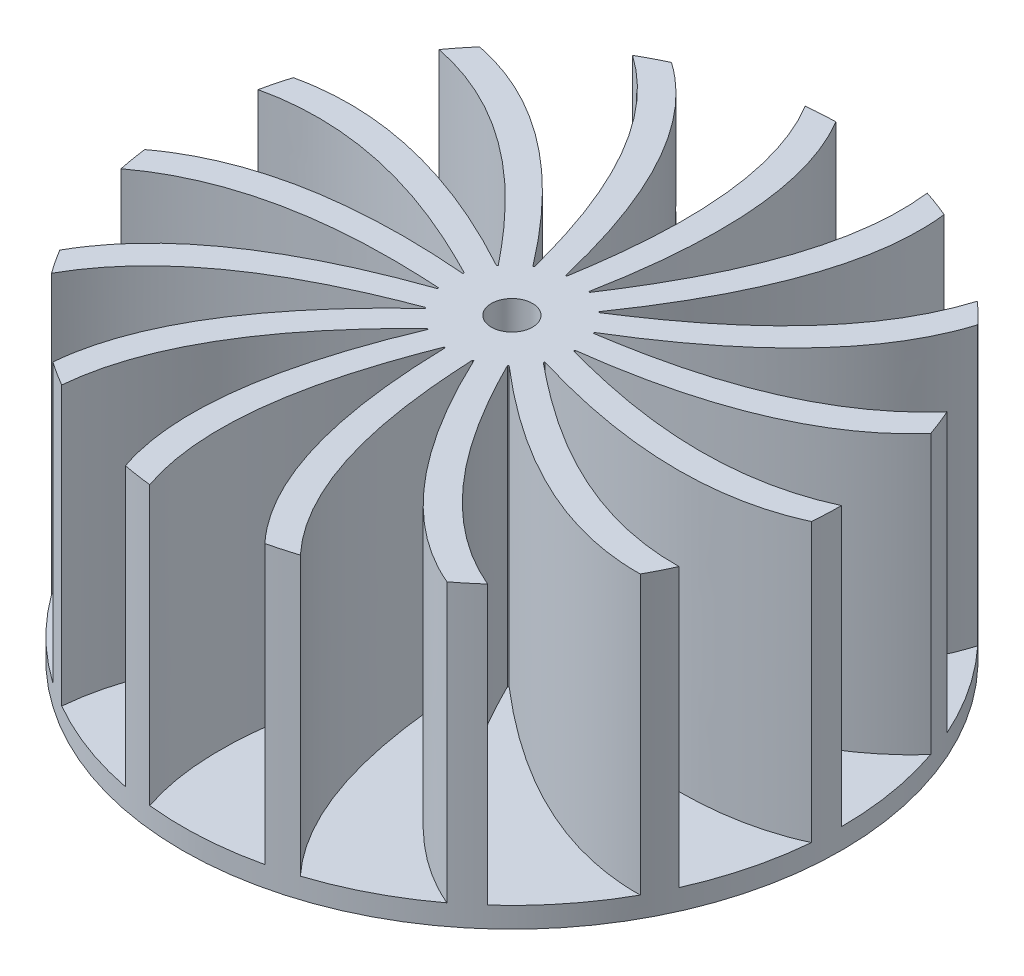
ISO-10303-21;
HEADER;
FILE_DESCRIPTION(('STEP AP214'),'2;1');
FILE_NAME('part.step','',(''),(''),'','','');
FILE_SCHEMA(('AUTOMOTIVE_DESIGN { 1 0 10303 214 1 1 1 1 }'));
ENDSEC;
DATA;
#1=APPLICATION_CONTEXT('core data for automotive mechanical design processes');
#2=APPLICATION_PROTOCOL_DEFINITION('international standard','automotive_design',2000,#1);
#3=PRODUCT_CONTEXT('',#1,'mechanical');
#4=PRODUCT('Part','Part','',(#3));
#5=PRODUCT_RELATED_PRODUCT_CATEGORY('part','',(#4));
#6=PRODUCT_DEFINITION_FORMATION('','',#4);
#7=PRODUCT_DEFINITION_CONTEXT('part definition',#1,'design');
#8=PRODUCT_DEFINITION('design','',#6,#7);
#9=PRODUCT_DEFINITION_SHAPE('','',#8);
#10=(LENGTH_UNIT() NAMED_UNIT(*) SI_UNIT(.MILLI.,.METRE.));
#11=(NAMED_UNIT(*) PLANE_ANGLE_UNIT() SI_UNIT($,.RADIAN.));
#12=(NAMED_UNIT(*) SI_UNIT($,.STERADIAN.) SOLID_ANGLE_UNIT());
#13=UNCERTAINTY_MEASURE_WITH_UNIT(LENGTH_MEASURE(1.E-05),#10,'distance_accuracy_value','');
#14=(GEOMETRIC_REPRESENTATION_CONTEXT(3) GLOBAL_UNCERTAINTY_ASSIGNED_CONTEXT((#13)) GLOBAL_UNIT_ASSIGNED_CONTEXT((#10,
#11,#12)) REPRESENTATION_CONTEXT('',''));
#15=CARTESIAN_POINT('',(0.,0.,0.));
#16=DIRECTION('',(0.,0.,1.));
#17=DIRECTION('',(1.,0.,0.));
#18=AXIS2_PLACEMENT_3D('',#15,#16,#17);
#19=CARTESIAN_POINT('',(0.,1.,0.));
#20=DIRECTION('',(0.,1.,0.));
#21=DIRECTION('',(0.,0.,1.));
#22=AXIS2_PLACEMENT_3D('',#19,#20,#21);
#23=PLANE('',#22);
#24=CARTESIAN_POINT('',(0.,1.,0.));
#25=DIRECTION('',(0.,1.,0.));
#26=DIRECTION('',(0.,0.,1.));
#27=AXIS2_PLACEMENT_3D('',#24,#25,#26);
#28=CIRCLE('',#27,3.);
#29=CARTESIAN_POINT('',(2.74063637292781,1.,-1.22020992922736));
#30=VERTEX_POINT('',#29);
#31=CARTESIAN_POINT('',(2.715633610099,1.,-1.27488591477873));
#32=VERTEX_POINT('',#31);
#33=EDGE_CURVE('E53',#30,#32,#28,.T.);
#34=ORIENTED_EDGE('',*,*,#33,.F.);
#35=CARTESIAN_POINT('',(14.6167273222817,1.,-6.50778628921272));
#36=CARTESIAN_POINT('',(11.3508828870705,1.,-2.76138903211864));
#37=CARTESIAN_POINT('',(5.85732627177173,1.,-1.70114399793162));
#38=CARTESIAN_POINT('',(2.74063637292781,1.,-1.22020992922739));
#39=B_SPLINE_CURVE_WITH_KNOTS('',3,(#35,#36,#37,#38),.UNSPECIFIED.,.F.,.F.,(4,4),(0.,1.),.UNSPECIFIED.);
#40=CARTESIAN_POINT('',(14.6167273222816,1.,-6.50778628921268));
#41=VERTEX_POINT('',#40);
#42=EDGE_CURVE('E427',#41,#30,#39,.T.);
#43=ORIENTED_EDGE('',*,*,#42,.F.);
#44=CARTESIAN_POINT('',(0.,1.,0.));
#45=DIRECTION('',(0.,1.,0.));
#46=DIRECTION('',(0.,0.,1.));
#47=AXIS2_PLACEMENT_3D('',#44,#45,#46);
#48=CIRCLE('',#47,16.);
#49=CARTESIAN_POINT('',(11.7050130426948,1.,-10.9083761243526));
#50=VERTEX_POINT('',#49);
#51=EDGE_CURVE('E439',#41,#50,#48,.T.);
#52=ORIENTED_EDGE('',*,*,#51,.T.);
#53=CARTESIAN_POINT('',(2.71563361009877,1.,-1.27488591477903));
#54=CARTESIAN_POINT('',(10.1264739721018,1.,-5.77075236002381));
#55=CARTESIAN_POINT('',(11.7050130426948,1.,-10.9083761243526));
#56=B_SPLINE_CURVE_WITH_KNOTS('',2,(#53,#54,#55),.UNSPECIFIED.,.F.,.F.,(3,3),(0.,1.),.UNSPECIFIED.);
#57=EDGE_CURVE('E1108',#32,#50,#56,.T.);
#58=ORIENTED_EDGE('',*,*,#57,.F.);
#59=EDGE_LOOP('',(#34,#43,#52,#58));
#60=FACE_BOUND('',#59,.T.);
#61=ADVANCED_FACE('F43',(#60),#23,.T.);
#62=CARTESIAN_POINT('',(16.,1.,0.));
#63=VERTEX_POINT('',#62);
#64=CARTESIAN_POINT('',(15.1298977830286,1.,-5.20443974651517));
#65=VERTEX_POINT('',#64);
#66=EDGE_CURVE('E451',#63,#65,#48,.T.);
#67=ORIENTED_EDGE('',*,*,#66,.T.);
#68=CARTESIAN_POINT('',(2.99939756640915,1.,-0.0601185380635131));
#69=CARTESIAN_POINT('',(11.5981707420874,1.,-1.15303657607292));
#70=CARTESIAN_POINT('',(15.1298977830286,1.,-5.20443974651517));
#71=B_SPLINE_CURVE_WITH_KNOTS('',2,(#68,#69,#70),.UNSPECIFIED.,.F.,.F.,(3,3),(0.,1.),.UNSPECIFIED.);
#72=CARTESIAN_POINT('',(2.99939756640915,1.,-0.0601185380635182));
#73=VERTEX_POINT('',#72);
#74=EDGE_CURVE('E442',#73,#65,#71,.T.);
#75=ORIENTED_EDGE('',*,*,#74,.F.);
#76=CARTESIAN_POINT('',(3.00000000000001,1.,0.));
#77=VERTEX_POINT('',#76);
#78=EDGE_CURVE('E11',#77,#73,#28,.T.);
#79=ORIENTED_EDGE('',*,*,#78,.F.);
#80=CARTESIAN_POINT('',(16.,1.,0.));
#81=CARTESIAN_POINT('',(11.4927056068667,1.,2.09416559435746));
#82=CARTESIAN_POINT('',(6.04285140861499,1.,0.828316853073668));
#83=CARTESIAN_POINT('',(3.,1.,0.));
#84=B_SPLINE_CURVE_WITH_KNOTS('',3,(#80,#81,#82,#83),.UNSPECIFIED.,.F.,.F.,(4,4),(0.,1.),.UNSPECIFIED.);
#85=EDGE_CURVE('E488',#63,#77,#84,.T.);
#86=ORIENTED_EDGE('',*,*,#85,.F.);
#87=EDGE_LOOP('',(#67,#75,#79,#86));
#88=FACE_BOUND('',#87,.T.);
#89=ADVANCED_FACE('F552',(#88),#23,.T.);
#90=CARTESIAN_POINT('',(0.,14.5,0.));
#91=DIRECTION('',(0.,-1.,0.));
#92=DIRECTION('',(0.,0.,-1.));
#93=AXIS2_PLACEMENT_3D('',#90,#91,#92);
#94=CYLINDRICAL_SURFACE('',#93,3.);
#95=DIRECTION('',(0.,-1.,0.));
#96=VECTOR('',#95,1.);
#97=CARTESIAN_POINT('',(2.74063637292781,14.5,-1.22020992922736));
#98=LINE('',#97,#96);
#99=CARTESIAN_POINT('',(2.74063637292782,14.5,-1.22020992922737));
#100=VERTEX_POINT('',#99);
#101=EDGE_CURVE('E62',#100,#30,#98,.T.);
#102=ORIENTED_EDGE('',*,*,#101,.T.);
#103=ORIENTED_EDGE('',*,*,#33,.T.);
#104=DIRECTION('',(0.,-1.,0.));
#105=VECTOR('',#104,1.);
#106=CARTESIAN_POINT('',(2.715633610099,14.5,-1.27488591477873));
#107=LINE('',#106,#105);
#108=CARTESIAN_POINT('',(2.715633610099,14.5,-1.27488591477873));
#109=VERTEX_POINT('',#108);
#110=EDGE_CURVE('E1125',#109,#32,#107,.T.);
#111=ORIENTED_EDGE('',*,*,#110,.F.);
#112=CARTESIAN_POINT('',(0.,14.5,0.));
#113=DIRECTION('',(0.,1.,0.));
#114=DIRECTION('',(0.,0.,1.));
#115=AXIS2_PLACEMENT_3D('',#112,#113,#114);
#116=CIRCLE('',#115,3.);
#117=EDGE_CURVE('E463',#100,#109,#116,.T.);
#118=ORIENTED_EDGE('',*,*,#117,.F.);
#119=EDGE_LOOP('',(#102,#103,#111,#118));
#120=FACE_BOUND('',#119,.T.);
#121=ADVANCED_FACE('F539',(#120),#94,.T.);
#122=DIRECTION('',(0.,-1.,0.));
#123=VECTOR('',#122,1.);
#124=CARTESIAN_POINT('',(2.99939756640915,14.5,-0.0601185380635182));
#125=LINE('',#124,#123);
#126=CARTESIAN_POINT('',(2.99939756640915,14.5,-0.0601185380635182));
#127=VERTEX_POINT('',#126);
#128=EDGE_CURVE('E1143',#127,#73,#125,.T.);
#129=ORIENTED_EDGE('',*,*,#128,.F.);
#130=CARTESIAN_POINT('',(3.,14.5,0.));
#131=VERTEX_POINT('',#130);
#132=EDGE_CURVE('E459',#131,#127,#116,.T.);
#133=ORIENTED_EDGE('',*,*,#132,.F.);
#134=DIRECTION('',(0.,-1.,0.));
#135=VECTOR('',#134,1.);
#136=CARTESIAN_POINT('',(3.00000000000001,14.5,0.));
#137=LINE('',#136,#135);
#138=EDGE_CURVE('E465',#131,#77,#137,.T.);
#139=ORIENTED_EDGE('',*,*,#138,.T.);
#140=ORIENTED_EDGE('',*,*,#78,.T.);
#141=EDGE_LOOP('',(#129,#133,#139,#140));
#142=FACE_BOUND('',#141,.T.);
#143=ADVANCED_FACE('F561',(#142),#94,.T.);
#144=CARTESIAN_POINT('',(2.00739181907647,1.,-2.22943447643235));
#145=VERTEX_POINT('',#144);
#146=CARTESIAN_POINT('',(1.96231193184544,1.,-2.26921393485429));
#147=VERTEX_POINT('',#146);
#148=EDGE_CURVE('E1523',#145,#147,#28,.T.);
#149=ORIENTED_EDGE('',*,*,#148,.F.);
#150=CARTESIAN_POINT('',(10.7060897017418,1.,-11.8903172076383));
#151=CARTESIAN_POINT('',(9.24638939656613,1.,-7.13947440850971));
#152=CARTESIAN_POINT('',(4.65901621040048,1.,-3.93646159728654));
#153=CARTESIAN_POINT('',(2.00739181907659,1.,-2.22943447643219));
#154=B_SPLINE_CURVE_WITH_KNOTS('',3,(#150,#151,#152,#153),.UNSPECIFIED.,.F.,.F.,(4,4),(0.,1.),.UNSPECIFIED.);
#155=CARTESIAN_POINT('',(10.7060897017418,1.,-11.8903172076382));
#156=VERTEX_POINT('',#155);
#157=EDGE_CURVE('E1105',#156,#145,#154,.T.);
#158=ORIENTED_EDGE('',*,*,#157,.F.);
#159=CARTESIAN_POINT('',(6.25622521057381,1.,-14.7261551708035));
#160=VERTEX_POINT('',#159);
#161=EDGE_CURVE('E452',#156,#160,#48,.T.);
#162=ORIENTED_EDGE('',*,*,#161,.T.);
#163=CARTESIAN_POINT('',(1.96231193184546,1.,-2.26921393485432));
#164=CARTESIAN_POINT('',(6.90381785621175,1.,-9.39065263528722));
#165=CARTESIAN_POINT('',(6.25622521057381,1.,-14.7261551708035));
#166=B_SPLINE_CURVE_WITH_KNOTS('',2,(#163,#164,#165),.UNSPECIFIED.,.F.,.F.,(3,3),(0.,1.),.UNSPECIFIED.);
#167=EDGE_CURVE('E1076',#147,#160,#166,.T.);
#168=ORIENTED_EDGE('',*,*,#167,.F.);
#169=EDGE_LOOP('',(#149,#158,#162,#168));
#170=FACE_BOUND('',#169,.T.);
#171=ADVANCED_FACE('F557',(#170),#23,.T.);
#172=DIRECTION('',(0.,-1.,0.));
#173=VECTOR('',#172,1.);
#174=CARTESIAN_POINT('',(2.00739181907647,14.5,-2.22943447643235));
#175=LINE('',#174,#173);
#176=CARTESIAN_POINT('',(2.00739181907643,14.5,-2.22943447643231));
#177=VERTEX_POINT('',#176);
#178=EDGE_CURVE('E70',#177,#145,#175,.T.);
#179=ORIENTED_EDGE('',*,*,#178,.T.);
#180=ORIENTED_EDGE('',*,*,#148,.T.);
#181=DIRECTION('',(0.,-1.,0.));
#182=VECTOR('',#181,1.);
#183=CARTESIAN_POINT('',(1.96231193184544,14.5,-2.26921393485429));
#184=LINE('',#183,#182);
#185=CARTESIAN_POINT('',(1.96231193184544,14.5,-2.26921393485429));
#186=VERTEX_POINT('',#185);
#187=EDGE_CURVE('E1097',#186,#147,#184,.T.);
#188=ORIENTED_EDGE('',*,*,#187,.F.);
#189=EDGE_CURVE('E705',#177,#186,#116,.T.);
#190=ORIENTED_EDGE('',*,*,#189,.F.);
#191=EDGE_LOOP('',(#179,#180,#188,#190));
#192=FACE_BOUND('',#191,.T.);
#193=ADVANCED_FACE('F564',(#192),#94,.T.);
#194=CARTESIAN_POINT('',(0.927050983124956,1.,-2.85316954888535));
#195=VERTEX_POINT('',#194);
#196=CARTESIAN_POINT('',(0.869688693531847,1.,-2.87117425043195));
#197=VERTEX_POINT('',#196);
#198=EDGE_CURVE('E1521',#195,#197,#28,.T.);
#199=ORIENTED_EDGE('',*,*,#198,.F.);
#200=CARTESIAN_POINT('',(4.94427190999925,1.,-15.2169042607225));
#201=CARTESIAN_POINT('',(5.54311117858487,1.,-10.2830797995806));
#202=CARTESIAN_POINT('',(2.65511992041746,1.,-5.4911292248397));
#203=CARTESIAN_POINT('',(0.927050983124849,1.,-2.85316954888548));
#204=B_SPLINE_CURVE_WITH_KNOTS('',3,(#200,#201,#202,#203),.UNSPECIFIED.,.F.,.F.,(4,4),(0.,1.),.UNSPECIFIED.);
#205=CARTESIAN_POINT('',(4.94427190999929,1.,-15.2169042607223));
#206=VERTEX_POINT('',#205);
#207=EDGE_CURVE('E1073',#206,#195,#204,.T.);
#208=ORIENTED_EDGE('',*,*,#207,.F.);
#209=CARTESIAN_POINT('',(-0.274320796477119,1.,-15.9976482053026));
#210=VERTEX_POINT('',#209);
#211=EDGE_CURVE('E457',#206,#210,#48,.T.);
#212=ORIENTED_EDGE('',*,*,#211,.T.);
#213=CARTESIAN_POINT('',(0.869688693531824,1.,-2.87117425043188));
#214=CARTESIAN_POINT('',(2.48742891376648,1.,-11.3868237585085));
#215=CARTESIAN_POINT('',(-0.274320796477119,1.,-15.9976482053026));
#216=B_SPLINE_CURVE_WITH_KNOTS('',2,(#213,#214,#215),.UNSPECIFIED.,.F.,.F.,(3,3),(0.,1.),.UNSPECIFIED.);
#217=EDGE_CURVE('E1044',#197,#210,#216,.T.);
#218=ORIENTED_EDGE('',*,*,#217,.F.);
#219=EDGE_LOOP('',(#199,#208,#212,#218));
#220=FACE_BOUND('',#219,.T.);
#221=ADVANCED_FACE('F566',(#220),#23,.T.);
#222=DIRECTION('',(0.,-1.,0.));
#223=VECTOR('',#222,1.);
#224=CARTESIAN_POINT('',(0.927050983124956,14.5,-2.85316954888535));
#225=LINE('',#224,#223);
#226=CARTESIAN_POINT('',(0.927050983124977,14.5,-2.85316954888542));
#227=VERTEX_POINT('',#226);
#228=EDGE_CURVE('E1101',#227,#195,#225,.T.);
#229=ORIENTED_EDGE('',*,*,#228,.T.);
#230=ORIENTED_EDGE('',*,*,#198,.T.);
#231=DIRECTION('',(0.,-1.,0.));
#232=VECTOR('',#231,1.);
#233=CARTESIAN_POINT('',(0.869688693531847,14.5,-2.87117425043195));
#234=LINE('',#233,#232);
#235=CARTESIAN_POINT('',(0.869688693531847,14.5,-2.87117425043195));
#236=VERTEX_POINT('',#235);
#237=EDGE_CURVE('E1065',#236,#197,#234,.T.);
#238=ORIENTED_EDGE('',*,*,#237,.F.);
#239=EDGE_CURVE('E707',#227,#236,#116,.T.);
#240=ORIENTED_EDGE('',*,*,#239,.F.);
#241=EDGE_LOOP('',(#229,#230,#238,#240));
#242=FACE_BOUND('',#241,.T.);
#243=ADVANCED_FACE('F572',(#242),#94,.T.);
#244=CARTESIAN_POINT('',(-0.313585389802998,1.,-2.98356568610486));
#245=VERTEX_POINT('',#244);
#246=CARTESIAN_POINT('',(-0.373311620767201,1.,-2.97668245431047));
#247=VERTEX_POINT('',#246);
#248=EDGE_CURVE('E1524',#245,#247,#28,.T.);
#249=ORIENTED_EDGE('',*,*,#248,.F.);
#250=CARTESIAN_POINT('',(-1.6724554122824,1.,-15.9123503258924));
#251=CARTESIAN_POINT('',(0.881378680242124,1.,-11.6486472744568));
#252=CARTESIAN_POINT('',(0.192129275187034,1.,-6.09633072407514));
#253=CARTESIAN_POINT('',(-0.313585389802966,1.,-2.98356568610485));
#254=B_SPLINE_CURVE_WITH_KNOTS('',3,(#250,#251,#252,#253),.UNSPECIFIED.,.F.,.F.,(4,4),(0.,1.),.UNSPECIFIED.);
#255=CARTESIAN_POINT('',(-1.67245541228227,1.,-15.9123503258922));
#256=VERTEX_POINT('',#255);
#257=EDGE_CURVE('E1041',#256,#245,#254,.T.);
#258=ORIENTED_EDGE('',*,*,#257,.F.);
#259=CARTESIAN_POINT('',(-6.75743424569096,1.,-14.5030025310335));
#260=VERTEX_POINT('',#259);
#261=EDGE_CURVE('E1499',#256,#260,#48,.T.);
#262=ORIENTED_EDGE('',*,*,#261,.T.);
#263=CARTESIAN_POINT('',(-0.373311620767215,1.,-2.97668245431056));
#264=CARTESIAN_POINT('',(-2.3590590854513,1.,-11.4141096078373));
#265=CARTESIAN_POINT('',(-6.75743424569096,1.,-14.5030025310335));
#266=B_SPLINE_CURVE_WITH_KNOTS('',2,(#263,#264,#265),.UNSPECIFIED.,.F.,.F.,(3,3),(0.,1.),.UNSPECIFIED.);
#267=EDGE_CURVE('E1012',#247,#260,#266,.T.);
#268=ORIENTED_EDGE('',*,*,#267,.F.);
#269=EDGE_LOOP('',(#249,#258,#262,#268));
#270=FACE_BOUND('',#269,.T.);
#271=ADVANCED_FACE('F577',(#270),#23,.T.);
#272=DIRECTION('',(0.,-1.,0.));
#273=VECTOR('',#272,1.);
#274=CARTESIAN_POINT('',(-0.313585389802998,14.5,-2.98356568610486));
#275=LINE('',#274,#273);
#276=CARTESIAN_POINT('',(-0.313585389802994,14.5,-2.98356568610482));
#277=VERTEX_POINT('',#276);
#278=EDGE_CURVE('E1069',#277,#245,#275,.T.);
#279=ORIENTED_EDGE('',*,*,#278,.T.);
#280=ORIENTED_EDGE('',*,*,#248,.T.);
#281=DIRECTION('',(0.,-1.,0.));
#282=VECTOR('',#281,1.);
#283=CARTESIAN_POINT('',(-0.373311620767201,14.5,-2.97668245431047));
#284=LINE('',#283,#282);
#285=CARTESIAN_POINT('',(-0.373311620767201,14.5,-2.97668245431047));
#286=VERTEX_POINT('',#285);
#287=EDGE_CURVE('E1033',#286,#247,#284,.T.);
#288=ORIENTED_EDGE('',*,*,#287,.F.);
#289=EDGE_CURVE('E709',#277,#286,#116,.T.);
#290=ORIENTED_EDGE('',*,*,#289,.F.);
#291=EDGE_LOOP('',(#279,#280,#288,#290));
#292=FACE_BOUND('',#291,.T.);
#293=ADVANCED_FACE('F582',(#292),#94,.T.);
#294=CARTESIAN_POINT('',(-1.49999999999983,1.,-2.59807621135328));
#295=VERTEX_POINT('',#294);
#296=CARTESIAN_POINT('',(-1.55176296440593,1.,-2.5674952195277));
#297=VERTEX_POINT('',#296);
#298=EDGE_CURVE('E1527',#295,#297,#28,.T.);
#299=ORIENTED_EDGE('',*,*,#298,.F.);
#300=CARTESIAN_POINT('',(-7.99999999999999,1.,-13.8564064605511));
#301=CARTESIAN_POINT('',(-3.93275219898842,1.,-11.0000578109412));
#302=CARTESIAN_POINT('',(-2.30408226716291,1.,-5.64742125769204));
#303=CARTESIAN_POINT('',(-1.50000000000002,1.,-2.59807621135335));
#304=B_SPLINE_CURVE_WITH_KNOTS('',3,(#300,#301,#302,#303),.UNSPECIFIED.,.F.,.F.,(4,4),(0.,1.),.UNSPECIFIED.);
#305=CARTESIAN_POINT('',(-7.99999999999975,1.,-13.8564064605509));
#306=VERTEX_POINT('',#305);
#307=EDGE_CURVE('E1009',#306,#295,#304,.T.);
#308=ORIENTED_EDGE('',*,*,#307,.F.);
#309=CARTESIAN_POINT('',(-12.0721259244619,1.,-10.500655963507));
#310=VERTEX_POINT('',#309);
#311=EDGE_CURVE('E1494',#306,#310,#48,.T.);
#312=ORIENTED_EDGE('',*,*,#311,.T.);
#313=CARTESIAN_POINT('',(-1.551762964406,1.,-2.56749521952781));
#314=CARTESIAN_POINT('',(-6.79764433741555,1.,-9.4677922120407));
#315=CARTESIAN_POINT('',(-12.0721259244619,1.,-10.500655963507));
#316=B_SPLINE_CURVE_WITH_KNOTS('',2,(#313,#314,#315),.UNSPECIFIED.,.F.,.F.,(3,3),(0.,1.),.UNSPECIFIED.);
#317=EDGE_CURVE('E980',#297,#310,#316,.T.);
#318=ORIENTED_EDGE('',*,*,#317,.F.);
#319=EDGE_LOOP('',(#299,#308,#312,#318));
#320=FACE_BOUND('',#319,.T.);
#321=ADVANCED_FACE('F586',(#320),#23,.T.);
#322=DIRECTION('',(0.,-1.,0.));
#323=VECTOR('',#322,1.);
#324=CARTESIAN_POINT('',(-1.49999999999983,14.5,-2.59807621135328));
#325=LINE('',#324,#323);
#326=CARTESIAN_POINT('',(-1.49999999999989,14.5,-2.59807621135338));
#327=VERTEX_POINT('',#326);
#328=EDGE_CURVE('E1037',#327,#295,#325,.T.);
#329=ORIENTED_EDGE('',*,*,#328,.T.);
#330=ORIENTED_EDGE('',*,*,#298,.T.);
#331=DIRECTION('',(0.,-1.,0.));
#332=VECTOR('',#331,1.);
#333=CARTESIAN_POINT('',(-1.55176296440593,14.5,-2.5674952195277));
#334=LINE('',#333,#332);
#335=CARTESIAN_POINT('',(-1.55176296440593,14.5,-2.5674952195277));
#336=VERTEX_POINT('',#335);
#337=EDGE_CURVE('E1001',#336,#297,#334,.T.);
#338=ORIENTED_EDGE('',*,*,#337,.F.);
#339=EDGE_CURVE('E711',#327,#336,#116,.T.);
#340=ORIENTED_EDGE('',*,*,#339,.F.);
#341=EDGE_LOOP('',(#329,#330,#338,#340));
#342=FACE_BOUND('',#341,.T.);
#343=ADVANCED_FACE('F591',(#342),#94,.T.);
#344=CARTESIAN_POINT('',(-2.42705098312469,1.,-1.76335575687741));
#345=VERTEX_POINT('',#344);
#346=CARTESIAN_POINT('',(-2.4619003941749,1.,-1.71436473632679));
#347=VERTEX_POINT('',#346);
#348=EDGE_CURVE('E1530',#345,#347,#28,.T.);
#349=ORIENTED_EDGE('',*,*,#348,.F.);
#350=CARTESIAN_POINT('',(-12.9442719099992,1.,-9.40456403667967));
#351=CARTESIAN_POINT('',(-8.06687449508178,1.,-8.44945841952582));
#352=CARTESIAN_POINT('',(-4.40189705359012,1.,-4.22202135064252));
#353=CARTESIAN_POINT('',(-2.42705098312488,1.,-1.76335575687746));
#354=B_SPLINE_CURVE_WITH_KNOTS('',3,(#350,#351,#352,#353),.UNSPECIFIED.,.F.,.F.,(4,4),(0.,1.),.UNSPECIFIED.);
#355=CARTESIAN_POINT('',(-12.9442719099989,1.,-9.4045640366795));
#356=VERTEX_POINT('',#355);
#357=EDGE_CURVE('E977',#356,#345,#354,.T.);
#358=ORIENTED_EDGE('',*,*,#357,.F.);
#359=CARTESIAN_POINT('',(-15.2994373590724,1.,-4.68265058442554));
#360=VERTEX_POINT('',#359);
#361=EDGE_CURVE('E1489',#356,#360,#48,.T.);
#362=ORIENTED_EDGE('',*,*,#361,.T.);
#363=CARTESIAN_POINT('',(-2.46190039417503,1.,-1.71436473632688));
#364=CARTESIAN_POINT('',(-10.0608551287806,1.,-5.88440753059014));
#365=CARTESIAN_POINT('',(-15.2994373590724,1.,-4.68265058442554));
#366=B_SPLINE_CURVE_WITH_KNOTS('',2,(#363,#364,#365),.UNSPECIFIED.,.F.,.F.,(3,3),(0.,1.),.UNSPECIFIED.);
#367=EDGE_CURVE('E948',#347,#360,#366,.T.);
#368=ORIENTED_EDGE('',*,*,#367,.F.);
#369=EDGE_LOOP('',(#349,#358,#362,#368));
#370=FACE_BOUND('',#369,.T.);
#371=ADVANCED_FACE('F595',(#370),#23,.T.);
#372=DIRECTION('',(0.,-1.,0.));
#373=VECTOR('',#372,1.);
#374=CARTESIAN_POINT('',(-2.42705098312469,14.5,-1.76335575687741));
#375=LINE('',#374,#373);
#376=CARTESIAN_POINT('',(-2.42705098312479,14.5,-1.76335575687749));
#377=VERTEX_POINT('',#376);
#378=EDGE_CURVE('E1005',#377,#345,#375,.T.);
#379=ORIENTED_EDGE('',*,*,#378,.T.);
#380=ORIENTED_EDGE('',*,*,#348,.T.);
#381=DIRECTION('',(0.,-1.,0.));
#382=VECTOR('',#381,1.);
#383=CARTESIAN_POINT('',(-2.4619003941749,14.5,-1.71436473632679));
#384=LINE('',#383,#382);
#385=CARTESIAN_POINT('',(-2.4619003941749,14.5,-1.71436473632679));
#386=VERTEX_POINT('',#385);
#387=EDGE_CURVE('E969',#386,#347,#384,.T.);
#388=ORIENTED_EDGE('',*,*,#387,.F.);
#389=EDGE_CURVE('E713',#377,#386,#116,.T.);
#390=ORIENTED_EDGE('',*,*,#389,.F.);
#391=EDGE_LOOP('',(#379,#380,#388,#390));
#392=FACE_BOUND('',#391,.T.);
#393=ADVANCED_FACE('F600',(#392),#94,.T.);
#394=CARTESIAN_POINT('',(-2.93444280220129,1.,-0.623735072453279));
#395=VERTEX_POINT('',#394);
#396=CARTESIAN_POINT('',(-2.94635288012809,1.,-0.56480501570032));
#397=VERTEX_POINT('',#396);
#398=EDGE_CURVE('E1533',#395,#397,#28,.T.);
#399=ORIENTED_EDGE('',*,*,#398,.F.);
#400=CARTESIAN_POINT('',(-15.650361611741,1.,-3.32658705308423));
#401=CARTESIAN_POINT('',(-10.8061609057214,1.,-4.43787090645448));
#402=CARTESIAN_POINT('',(-5.7385838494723,1.,-2.06659559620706));
#403=CARTESIAN_POINT('',(-2.93444280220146,1.,-0.623735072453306));
#404=B_SPLINE_CURVE_WITH_KNOTS('',3,(#400,#401,#402,#403),.UNSPECIFIED.,.F.,.F.,(4,4),(0.,1.),.UNSPECIFIED.);
#405=CARTESIAN_POINT('',(-15.6503616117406,1.,-3.32658705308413));
#406=VERTEX_POINT('',#405);
#407=EDGE_CURVE('E945',#406,#395,#404,.T.);
#408=ORIENTED_EDGE('',*,*,#407,.F.);
#409=CARTESIAN_POINT('',(-15.8813370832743,1.,1.94502762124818));
#410=VERTEX_POINT('',#409);
#411=EDGE_CURVE('E1484',#406,#410,#48,.T.);
#412=ORIENTED_EDGE('',*,*,#411,.T.);
#413=CARTESIAN_POINT('',(-2.94635288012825,1.,-0.56480501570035));
#414=CARTESIAN_POINT('',(-11.5844526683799,1.,-1.28355532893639));
#415=CARTESIAN_POINT('',(-15.8813370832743,1.,1.94502762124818));
#416=B_SPLINE_CURVE_WITH_KNOTS('',2,(#413,#414,#415),.UNSPECIFIED.,.F.,.F.,(3,3),(0.,1.),.UNSPECIFIED.);
#417=EDGE_CURVE('E916',#397,#410,#416,.T.);
#418=ORIENTED_EDGE('',*,*,#417,.F.);
#419=EDGE_LOOP('',(#399,#408,#412,#418));
#420=FACE_BOUND('',#419,.T.);
#421=ADVANCED_FACE('F604',(#420),#23,.T.);
#422=DIRECTION('',(0.,-1.,0.));
#423=VECTOR('',#422,1.);
#424=CARTESIAN_POINT('',(-2.93444280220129,14.5,-0.623735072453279));
#425=LINE('',#424,#423);
#426=CARTESIAN_POINT('',(-2.93444280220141,14.5,-0.623735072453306));
#427=VERTEX_POINT('',#426);
#428=EDGE_CURVE('E973',#427,#395,#425,.T.);
#429=ORIENTED_EDGE('',*,*,#428,.T.);
#430=ORIENTED_EDGE('',*,*,#398,.T.);
#431=DIRECTION('',(0.,-1.,0.));
#432=VECTOR('',#431,1.);
#433=CARTESIAN_POINT('',(-2.94635288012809,14.5,-0.56480501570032));
#434=LINE('',#433,#432);
#435=CARTESIAN_POINT('',(-2.94635288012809,14.5,-0.56480501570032));
#436=VERTEX_POINT('',#435);
#437=EDGE_CURVE('E937',#436,#397,#434,.T.);
#438=ORIENTED_EDGE('',*,*,#437,.F.);
#439=EDGE_CURVE('E715',#427,#436,#116,.T.);
#440=ORIENTED_EDGE('',*,*,#439,.F.);
#441=EDGE_LOOP('',(#429,#430,#438,#440));
#442=FACE_BOUND('',#441,.T.);
#443=ADVANCED_FACE('F609',(#442),#94,.T.);
#444=CARTESIAN_POINT('',(-2.9344428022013,1.,0.623735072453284));
#445=VERTEX_POINT('',#444);
#446=CARTESIAN_POINT('',(-2.92135418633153,1.,0.68241462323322));
#447=VERTEX_POINT('',#446);
#448=EDGE_CURVE('E1536',#445,#447,#28,.T.);
#449=ORIENTED_EDGE('',*,*,#448,.F.);
#450=CARTESIAN_POINT('',(-15.650361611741,1.,3.32658705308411));
#451=CARTESIAN_POINT('',(-11.6769639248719,1.,0.341064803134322));
#452=CARTESIAN_POINT('',(-6.0830173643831,1.,0.446163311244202));
#453=CARTESIAN_POINT('',(-2.93444280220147,1.,0.623735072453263));
#454=B_SPLINE_CURVE_WITH_KNOTS('',3,(#450,#451,#452,#453),.UNSPECIFIED.,.F.,.F.,(4,4),(0.,1.),.UNSPECIFIED.);
#455=CARTESIAN_POINT('',(-15.6503616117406,1.,3.32658705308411));
#456=VERTEX_POINT('',#455);
#457=EDGE_CURVE('E913',#456,#445,#454,.T.);
#458=ORIENTED_EDGE('',*,*,#457,.F.);
#459=CARTESIAN_POINT('',(-13.71720934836,1.,8.23639288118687));
#460=VERTEX_POINT('',#459);
#461=EDGE_CURVE('E1479',#456,#460,#48,.T.);
#462=ORIENTED_EDGE('',*,*,#461,.T.);
#463=CARTESIAN_POINT('',(-2.92135418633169,1.,0.682414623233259));
#464=CARTESIAN_POINT('',(-11.1049931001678,1.,3.53923524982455));
#465=CARTESIAN_POINT('',(-13.71720934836,1.,8.23639288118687));
#466=B_SPLINE_CURVE_WITH_KNOTS('',2,(#463,#464,#465),.UNSPECIFIED.,.F.,.F.,(3,3),(0.,1.),.UNSPECIFIED.);
#467=EDGE_CURVE('E884',#447,#460,#466,.T.);
#468=ORIENTED_EDGE('',*,*,#467,.F.);
#469=EDGE_LOOP('',(#449,#458,#462,#468));
#470=FACE_BOUND('',#469,.T.);
#471=ADVANCED_FACE('F613',(#470),#23,.T.);
#472=DIRECTION('',(0.,-1.,0.));
#473=VECTOR('',#472,1.);
#474=CARTESIAN_POINT('',(-2.9344428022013,14.5,0.623735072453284));
#475=LINE('',#474,#473);
#476=CARTESIAN_POINT('',(-2.93444280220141,14.5,0.623735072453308));
#477=VERTEX_POINT('',#476);
#478=EDGE_CURVE('E941',#477,#445,#475,.T.);
#479=ORIENTED_EDGE('',*,*,#478,.T.);
#480=ORIENTED_EDGE('',*,*,#448,.T.);
#481=DIRECTION('',(0.,-1.,0.));
#482=VECTOR('',#481,1.);
#483=CARTESIAN_POINT('',(-2.92135418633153,14.5,0.68241462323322));
#484=LINE('',#483,#482);
#485=CARTESIAN_POINT('',(-2.92135418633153,14.5,0.68241462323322));
#486=VERTEX_POINT('',#485);
#487=EDGE_CURVE('E905',#486,#447,#484,.T.);
#488=ORIENTED_EDGE('',*,*,#487,.F.);
#489=EDGE_CURVE('E717',#477,#486,#116,.T.);
#490=ORIENTED_EDGE('',*,*,#489,.F.);
#491=EDGE_LOOP('',(#479,#480,#488,#490));
#492=FACE_BOUND('',#491,.T.);
#493=ADVANCED_FACE('F618',(#492),#94,.T.);
#494=CARTESIAN_POINT('',(-2.42705098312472,1.,1.76335575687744));
#495=VERTEX_POINT('',#494);
#496=CARTESIAN_POINT('',(-2.39122681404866,1.,1.81163857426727));
#497=VERTEX_POINT('',#496);
#498=EDGE_CURVE('E1539',#495,#497,#28,.T.);
#499=ORIENTED_EDGE('',*,*,#498,.F.);
#500=CARTESIAN_POINT('',(-12.9442719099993,1.,9.40456403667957));
#501=CARTESIAN_POINT('',(-10.5287137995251,1.,5.06102730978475));
#502=CARTESIAN_POINT('',(-5.37564191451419,1.,2.8817765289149));
#503=CARTESIAN_POINT('',(-2.4270509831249,1.,1.76335575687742));
#504=B_SPLINE_CURVE_WITH_KNOTS('',3,(#500,#501,#502,#503),.UNSPECIFIED.,.F.,.F.,(4,4),(0.,1.),.UNSPECIFIED.);
#505=CARTESIAN_POINT('',(-12.9442719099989,1.,9.40456403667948));
#506=VERTEX_POINT('',#505);
#507=EDGE_CURVE('E881',#506,#495,#504,.T.);
#508=ORIENTED_EDGE('',*,*,#507,.F.);
#509=CARTESIAN_POINT('',(-9.18125150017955,1.,13.1036109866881));
#510=VERTEX_POINT('',#509);
#511=EDGE_CURVE('E1474',#506,#510,#48,.T.);
#512=ORIENTED_EDGE('',*,*,#511,.T.);
#513=CARTESIAN_POINT('',(-2.39122681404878,1.,1.81163857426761));
#514=CARTESIAN_POINT('',(-8.70537933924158,1.,7.75005990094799));
#515=CARTESIAN_POINT('',(-9.18125150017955,1.,13.1036109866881));
#516=B_SPLINE_CURVE_WITH_KNOTS('',2,(#513,#514,#515),.UNSPECIFIED.,.F.,.F.,(3,3),(0.,1.),.UNSPECIFIED.);
#517=EDGE_CURVE('E852',#497,#510,#516,.T.);
#518=ORIENTED_EDGE('',*,*,#517,.F.);
#519=EDGE_LOOP('',(#499,#508,#512,#518));
#520=FACE_BOUND('',#519,.T.);
#521=ADVANCED_FACE('F622',(#520),#23,.T.);
#522=DIRECTION('',(0.,-1.,0.));
#523=VECTOR('',#522,1.);
#524=CARTESIAN_POINT('',(-2.42705098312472,14.5,1.76335575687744));
#525=LINE('',#524,#523);
#526=CARTESIAN_POINT('',(-2.42705098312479,14.5,1.76335575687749));
#527=VERTEX_POINT('',#526);
#528=EDGE_CURVE('E909',#527,#495,#525,.T.);
#529=ORIENTED_EDGE('',*,*,#528,.T.);
#530=ORIENTED_EDGE('',*,*,#498,.T.);
#531=DIRECTION('',(0.,-1.,0.));
#532=VECTOR('',#531,1.);
#533=CARTESIAN_POINT('',(-2.39122681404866,14.5,1.81163857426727));
#534=LINE('',#533,#532);
#535=CARTESIAN_POINT('',(-2.39122681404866,14.5,1.81163857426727));
#536=VERTEX_POINT('',#535);
#537=EDGE_CURVE('E873',#536,#497,#534,.T.);
#538=ORIENTED_EDGE('',*,*,#537,.F.);
#539=EDGE_CURVE('E719',#527,#536,#116,.T.);
#540=ORIENTED_EDGE('',*,*,#539,.F.);
#541=EDGE_LOOP('',(#529,#530,#538,#540));
#542=FACE_BOUND('',#541,.T.);
#543=ADVANCED_FACE('F627',(#542),#94,.T.);
#544=CARTESIAN_POINT('',(-1.49999999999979,1.,2.5980762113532));
#545=VERTEX_POINT('',#544);
#546=CARTESIAN_POINT('',(-1.44763460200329,1.,2.62761375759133));
#547=VERTEX_POINT('',#546);
#548=EDGE_CURVE('E1542',#545,#547,#28,.T.);
#549=ORIENTED_EDGE('',*,*,#548,.F.);
#550=CARTESIAN_POINT('',(-8.00000000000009,1.,13.856406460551));
#551=CARTESIAN_POINT('',(-7.55995340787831,1.,8.90589221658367));
#552=CARTESIAN_POINT('',(-3.73876914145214,1.,4.81910440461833));
#553=CARTESIAN_POINT('',(-1.50000000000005,1.,2.59807621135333));
#554=B_SPLINE_CURVE_WITH_KNOTS('',3,(#550,#551,#552,#553),.UNSPECIFIED.,.F.,.F.,(4,4),(0.,1.),.UNSPECIFIED.);
#555=CARTESIAN_POINT('',(-7.99999999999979,1.,13.8564064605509));
#556=VERTEX_POINT('',#555);
#557=EDGE_CURVE('E849',#556,#545,#554,.T.);
#558=ORIENTED_EDGE('',*,*,#557,.F.);
#559=CARTESIAN_POINT('',(-3.05777185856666,1.,15.7050957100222));
#560=VERTEX_POINT('',#559);
#561=EDGE_CURVE('E1469',#556,#560,#48,.T.);
#562=ORIENTED_EDGE('',*,*,#561,.T.);
#563=CARTESIAN_POINT('',(-1.44763460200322,1.,2.62761375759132));
#564=CARTESIAN_POINT('',(-4.80052640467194,1.,10.6208287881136));
#565=CARTESIAN_POINT('',(-3.05777185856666,1.,15.7050957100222));
#566=B_SPLINE_CURVE_WITH_KNOTS('',2,(#563,#564,#565),.UNSPECIFIED.,.F.,.F.,(3,3),(0.,1.),.UNSPECIFIED.);
#567=EDGE_CURVE('E820',#547,#560,#566,.T.);
#568=ORIENTED_EDGE('',*,*,#567,.F.);
#569=EDGE_LOOP('',(#549,#558,#562,#568));
#570=FACE_BOUND('',#569,.T.);
#571=ADVANCED_FACE('F631',(#570),#23,.T.);
#572=DIRECTION('',(0.,-1.,0.));
#573=VECTOR('',#572,1.);
#574=CARTESIAN_POINT('',(-1.49999999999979,14.5,2.5980762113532));
#575=LINE('',#574,#573);
#576=CARTESIAN_POINT('',(-1.49999999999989,14.5,2.59807621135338));
#577=VERTEX_POINT('',#576);
#578=EDGE_CURVE('E877',#577,#545,#575,.T.);
#579=ORIENTED_EDGE('',*,*,#578,.T.);
#580=ORIENTED_EDGE('',*,*,#548,.T.);
#581=DIRECTION('',(0.,-1.,0.));
#582=VECTOR('',#581,1.);
#583=CARTESIAN_POINT('',(-1.44763460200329,14.5,2.62761375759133));
#584=LINE('',#583,#582);
#585=CARTESIAN_POINT('',(-1.44763460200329,14.5,2.62761375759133));
#586=VERTEX_POINT('',#585);
#587=EDGE_CURVE('E841',#586,#547,#584,.T.);
#588=ORIENTED_EDGE('',*,*,#587,.F.);
#589=EDGE_CURVE('E721',#577,#586,#116,.T.);
#590=ORIENTED_EDGE('',*,*,#589,.F.);
#591=EDGE_LOOP('',(#579,#580,#588,#590));
#592=FACE_BOUND('',#591,.T.);
#593=ADVANCED_FACE('F636',(#592),#94,.T.);
#594=CARTESIAN_POINT('',(-0.313585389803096,1.,2.98356568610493));
#595=VERTEX_POINT('',#594);
#596=CARTESIAN_POINT('',(-0.253733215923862,1.,2.98925065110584));
#597=VERTEX_POINT('',#596);
#598=EDGE_CURVE('E684',#595,#597,#28,.T.);
#599=ORIENTED_EDGE('',*,*,#598,.F.);
#600=CARTESIAN_POINT('',(-1.67245541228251,1.,15.9123503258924));
#601=CARTESIAN_POINT('',(-3.28400839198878,1.,11.2108474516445));
#602=CARTESIAN_POINT('',(-1.45542921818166,1.,5.92316534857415));
#603=CARTESIAN_POINT('',(-0.313585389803,1.,2.98356568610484));
#604=B_SPLINE_CURVE_WITH_KNOTS('',3,(#600,#601,#602,#603),.UNSPECIFIED.,.F.,.F.,(4,4),(0.,1.),.UNSPECIFIED.);
#605=CARTESIAN_POINT('',(-1.6724554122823,1.,15.9123503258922));
#606=VERTEX_POINT('',#605);
#607=EDGE_CURVE('E817',#606,#595,#604,.T.);
#608=ORIENTED_EDGE('',*,*,#607,.F.);
#609=CARTESIAN_POINT('',(3.59442431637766,1.,15.5910267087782));
#610=VERTEX_POINT('',#609);
#611=EDGE_CURVE('E1467',#606,#610,#48,.T.);
#612=ORIENTED_EDGE('',*,*,#611,.T.);
#613=CARTESIAN_POINT('',(-0.253733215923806,1.,2.98925065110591));
#614=CARTESIAN_POINT('',(-0.0656188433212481,1.,11.655159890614));
#615=CARTESIAN_POINT('',(3.59442431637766,1.,15.5910267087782));
#616=B_SPLINE_CURVE_WITH_KNOTS('',2,(#613,#614,#615),.UNSPECIFIED.,.F.,.F.,(3,3),(0.,1.),.UNSPECIFIED.);
#617=EDGE_CURVE('E788',#597,#610,#616,.T.);
#618=ORIENTED_EDGE('',*,*,#617,.F.);
#619=EDGE_LOOP('',(#599,#608,#612,#618));
#620=FACE_BOUND('',#619,.T.);
#621=ADVANCED_FACE('F640',(#620),#23,.T.);
#622=DIRECTION('',(0.,-1.,0.));
#623=VECTOR('',#622,1.);
#624=CARTESIAN_POINT('',(-0.313585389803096,14.5,2.98356568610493));
#625=LINE('',#624,#623);
#626=CARTESIAN_POINT('',(-0.313585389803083,14.5,2.98356568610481));
#627=VERTEX_POINT('',#626);
#628=EDGE_CURVE('E845',#627,#595,#625,.T.);
#629=ORIENTED_EDGE('',*,*,#628,.T.);
#630=ORIENTED_EDGE('',*,*,#598,.T.);
#631=DIRECTION('',(0.,-1.,0.));
#632=VECTOR('',#631,1.);
#633=CARTESIAN_POINT('',(-0.253733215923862,14.5,2.98925065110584));
#634=LINE('',#633,#632);
#635=CARTESIAN_POINT('',(-0.253733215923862,14.5,2.98925065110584));
#636=VERTEX_POINT('',#635);
#637=EDGE_CURVE('E809',#636,#597,#634,.T.);
#638=ORIENTED_EDGE('',*,*,#637,.F.);
#639=EDGE_CURVE('E723',#627,#636,#116,.T.);
#640=ORIENTED_EDGE('',*,*,#639,.F.);
#641=EDGE_LOOP('',(#629,#630,#638,#640));
#642=FACE_BOUND('',#641,.T.);
#643=ADVANCED_FACE('F645',(#642),#94,.T.);
#644=CARTESIAN_POINT('',(0.927050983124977,1.,2.85316954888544));
#645=VERTEX_POINT('',#644);
#646=CARTESIAN_POINT('',(0.984040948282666,1.,2.83401895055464));
#647=VERTEX_POINT('',#646);
#648=EDGE_CURVE('E681',#645,#647,#28,.T.);
#649=ORIENTED_EDGE('',*,*,#648,.F.);
#650=CARTESIAN_POINT('',(4.94427190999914,1.,15.2169042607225));
#651=CARTESIAN_POINT('',(1.55977150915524,1.,11.5773453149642));
#652=CARTESIAN_POINT('',(1.07956763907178,1.,6.0030571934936));
#653=CARTESIAN_POINT('',(0.927050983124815,1.,2.85316954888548));
#654=B_SPLINE_CURVE_WITH_KNOTS('',3,(#650,#651,#652,#653),.UNSPECIFIED.,.F.,.F.,(4,4),(0.,1.),.UNSPECIFIED.);
#655=CARTESIAN_POINT('',(4.94427190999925,1.,15.2169042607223));
#656=VERTEX_POINT('',#655);
#657=EDGE_CURVE('E785',#656,#645,#654,.T.);
#658=ORIENTED_EDGE('',*,*,#657,.F.);
#659=CARTESIAN_POINT('',(9.62511187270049,1.,12.7811275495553));
#660=VERTEX_POINT('',#659);
#661=EDGE_CURVE('E700',#656,#660,#48,.T.);
#662=ORIENTED_EDGE('',*,*,#661,.T.);
#663=CARTESIAN_POINT('',(0.984040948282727,1.,2.83401895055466));
#664=CARTESIAN_POINT('',(4.68063481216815,1.,10.6742079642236));
#665=CARTESIAN_POINT('',(9.62511187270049,1.,12.7811275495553));
#666=B_SPLINE_CURVE_WITH_KNOTS('',2,(#663,#664,#665),.UNSPECIFIED.,.F.,.F.,(3,3),(0.,1.),.UNSPECIFIED.);
#667=EDGE_CURVE('E757',#647,#660,#666,.T.);
#668=ORIENTED_EDGE('',*,*,#667,.F.);
#669=EDGE_LOOP('',(#649,#658,#662,#668));
#670=FACE_BOUND('',#669,.T.);
#671=ADVANCED_FACE('F649',(#670),#23,.T.);
#672=DIRECTION('',(0.,-1.,0.));
#673=VECTOR('',#672,1.);
#674=CARTESIAN_POINT('',(0.927050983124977,14.5,2.85316954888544));
#675=LINE('',#674,#673);
#676=CARTESIAN_POINT('',(0.927050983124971,14.5,2.85316954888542));
#677=VERTEX_POINT('',#676);
#678=EDGE_CURVE('E813',#677,#645,#675,.T.);
#679=ORIENTED_EDGE('',*,*,#678,.T.);
#680=ORIENTED_EDGE('',*,*,#648,.T.);
#681=DIRECTION('',(0.,-1.,0.));
#682=VECTOR('',#681,1.);
#683=CARTESIAN_POINT('',(0.984040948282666,14.5,2.83401895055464));
#684=LINE('',#683,#682);
#685=CARTESIAN_POINT('',(0.984040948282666,14.5,2.83401895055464));
#686=VERTEX_POINT('',#685);
#687=EDGE_CURVE('E778',#686,#647,#684,.T.);
#688=ORIENTED_EDGE('',*,*,#687,.F.);
#689=EDGE_CURVE('E725',#677,#686,#116,.T.);
#690=ORIENTED_EDGE('',*,*,#689,.F.);
#691=EDGE_LOOP('',(#679,#680,#688,#690));
#692=FACE_BOUND('',#691,.T.);
#693=ADVANCED_FACE('F654',(#692),#94,.T.);
#694=CARTESIAN_POINT('',(2.00739181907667,1.,2.22943447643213));
#695=VERTEX_POINT('',#694);
#696=CARTESIAN_POINT('',(2.05166549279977,1.,2.18875962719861));
#697=VERTEX_POINT('',#696);
#698=EDGE_CURVE('E672',#695,#697,#28,.T.);
#699=ORIENTED_EDGE('',*,*,#698,.F.);
#700=CARTESIAN_POINT('',(10.7060897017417,1.,11.8903172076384));
#701=CARTESIAN_POINT('',(6.13385274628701,1.,9.9420149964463));
#702=CARTESIAN_POINT('',(3.4278974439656,1.,5.04496591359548));
#703=CARTESIAN_POINT('',(2.00739181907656,1.,2.2294344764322));
#704=B_SPLINE_CURVE_WITH_KNOTS('',3,(#700,#701,#702,#703),.UNSPECIFIED.,.F.,.F.,(4,4),(0.,1.),.UNSPECIFIED.);
#705=CARTESIAN_POINT('',(10.7060897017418,1.,11.8903172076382));
#706=VERTEX_POINT('',#705);
#707=EDGE_CURVE('E673',#706,#695,#704,.T.);
#708=ORIENTED_EDGE('',*,*,#707,.F.);
#709=CARTESIAN_POINT('',(13.9915301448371,1.,7.76125532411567));
#710=VERTEX_POINT('',#709);
#711=EDGE_CURVE('E697',#706,#710,#48,.T.);
#712=ORIENTED_EDGE('',*,*,#711,.T.);
#713=CARTESIAN_POINT('',(2.05166549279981,1.,2.1887596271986));
#714=CARTESIAN_POINT('',(8.61756418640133,1.,7.84758850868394));
#715=CARTESIAN_POINT('',(13.9915301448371,1.,7.76125532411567));
#716=B_SPLINE_CURVE_WITH_KNOTS('',2,(#713,#714,#715),.UNSPECIFIED.,.F.,.F.,(3,3),(0.,1.),.UNSPECIFIED.);
#717=EDGE_CURVE('E676',#697,#710,#716,.T.);
#718=ORIENTED_EDGE('',*,*,#717,.F.);
#719=EDGE_LOOP('',(#699,#708,#712,#718));
#720=FACE_BOUND('',#719,.T.);
#721=ADVANCED_FACE('F543',(#720),#23,.T.);
#722=DIRECTION('',(0.,-1.,0.));
#723=VECTOR('',#722,1.);
#724=CARTESIAN_POINT('',(2.00739181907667,14.5,2.22943447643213));
#725=LINE('',#724,#723);
#726=CARTESIAN_POINT('',(2.00739181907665,14.5,2.22943447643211));
#727=VERTEX_POINT('',#726);
#728=EDGE_CURVE('E782',#727,#695,#725,.T.);
#729=ORIENTED_EDGE('',*,*,#728,.T.);
#730=ORIENTED_EDGE('',*,*,#698,.T.);
#731=DIRECTION('',(0.,-1.,0.));
#732=VECTOR('',#731,1.);
#733=CARTESIAN_POINT('',(2.05166549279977,14.5,2.18875962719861));
#734=LINE('',#733,#732);
#735=CARTESIAN_POINT('',(2.05166549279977,14.5,2.18875962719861));
#736=VERTEX_POINT('',#735);
#737=EDGE_CURVE('E750',#736,#697,#734,.T.);
#738=ORIENTED_EDGE('',*,*,#737,.F.);
#739=EDGE_CURVE('E727',#727,#736,#116,.T.);
#740=ORIENTED_EDGE('',*,*,#739,.F.);
#741=EDGE_LOOP('',(#729,#730,#738,#740));
#742=FACE_BOUND('',#741,.T.);
#743=ADVANCED_FACE('F540',(#742),#94,.T.);
#744=CARTESIAN_POINT('',(2.74063637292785,1.,1.22020992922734));
#745=VERTEX_POINT('',#744);
#746=CARTESIAN_POINT('',(2.76453843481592,1.,1.16504388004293));
#747=VERTEX_POINT('',#746);
#748=EDGE_CURVE('E55',#745,#747,#28,.T.);
#749=ORIENTED_EDGE('',*,*,#748,.F.);
#750=CARTESIAN_POINT('',(14.6167273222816,1.,6.50778628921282));
#751=CARTESIAN_POINT('',(9.64733511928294,1.,6.58761996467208));
#752=CARTESIAN_POINT('',(5.18351263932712,1.,3.21455419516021));
#753=CARTESIAN_POINT('',(2.7406363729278,1.,1.22020992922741));
#754=B_SPLINE_CURVE_WITH_KNOTS('',3,(#750,#751,#752,#753),.UNSPECIFIED.,.F.,.F.,(4,4),(0.,1.),.UNSPECIFIED.);
#755=CARTESIAN_POINT('',(14.6167273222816,1.,6.50778628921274));
#756=VERTEX_POINT('',#755);
#757=EDGE_CURVE('E496',#756,#745,#754,.T.);
#758=ORIENTED_EDGE('',*,*,#757,.F.);
#759=CARTESIAN_POINT('',(15.9386857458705,1.,1.39939154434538));
#760=VERTEX_POINT('',#759);
#761=EDGE_CURVE('E456',#756,#760,#48,.T.);
#762=ORIENTED_EDGE('',*,*,#761,.T.);
#763=CARTESIAN_POINT('',(2.76453843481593,1.,1.16504388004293));
#764=CARTESIAN_POINT('',(11.0644384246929,1.,3.66404970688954));
#765=CARTESIAN_POINT('',(15.9386857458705,1.,1.39939154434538));
#766=B_SPLINE_CURVE_WITH_KNOTS('',2,(#763,#764,#765),.UNSPECIFIED.,.F.,.F.,(3,3),(0.,1.),.UNSPECIFIED.);
#767=EDGE_CURVE('E481',#747,#760,#766,.T.);
#768=ORIENTED_EDGE('',*,*,#767,.F.);
#769=EDGE_LOOP('',(#749,#758,#762,#768));
#770=FACE_BOUND('',#769,.T.);
#771=ADVANCED_FACE('F537',(#770),#23,.T.);
#772=DIRECTION('',(0.,-1.,0.));
#773=VECTOR('',#772,1.);
#774=CARTESIAN_POINT('',(2.74063637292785,14.5,1.22020992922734));
#775=LINE('',#774,#773);
#776=CARTESIAN_POINT('',(2.74063637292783,14.5,1.22020992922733));
#777=VERTEX_POINT('',#776);
#778=EDGE_CURVE('E689',#777,#745,#775,.T.);
#779=ORIENTED_EDGE('',*,*,#778,.T.);
#780=ORIENTED_EDGE('',*,*,#748,.T.);
#781=DIRECTION('',(0.,-1.,0.));
#782=VECTOR('',#781,1.);
#783=CARTESIAN_POINT('',(2.76453843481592,14.5,1.16504388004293));
#784=LINE('',#783,#782);
#785=CARTESIAN_POINT('',(2.76453843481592,14.5,1.16504388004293));
#786=VERTEX_POINT('',#785);
#787=EDGE_CURVE('E469',#786,#747,#784,.T.);
#788=ORIENTED_EDGE('',*,*,#787,.F.);
#789=EDGE_CURVE('E464',#777,#786,#116,.T.);
#790=ORIENTED_EDGE('',*,*,#789,.F.);
#791=EDGE_LOOP('',(#779,#780,#788,#790));
#792=FACE_BOUND('',#791,.T.);
#793=ADVANCED_FACE('F534',(#792),#94,.T.);
#794=CARTESIAN_POINT('',(0.,1.,0.));
#795=DIRECTION('',(0.,-1.,0.));
#796=DIRECTION('',(0.,0.,-1.));
#797=AXIS2_PLACEMENT_3D('',#794,#795,#796);
#798=CYLINDRICAL_SURFACE('',#797,16.);
#799=ORIENTED_EDGE('',*,*,#66,.F.);
#800=DIRECTION('',(0.,-1.,0.));
#801=VECTOR('',#800,1.);
#802=CARTESIAN_POINT('',(16.,14.5,0.));
#803=LINE('',#802,#801);
#804=CARTESIAN_POINT('',(16.,14.5,0.));
#805=VERTEX_POINT('',#804);
#806=EDGE_CURVE('E477',#805,#63,#803,.T.);
#807=ORIENTED_EDGE('',*,*,#806,.F.);
#808=CARTESIAN_POINT('',(1.43592998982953E-13,14.5,0.));
#809=DIRECTION('',(0.,1.,0.));
#810=DIRECTION('',(0.,0.,-1.));
#811=AXIS2_PLACEMENT_3D('',#808,#809,#810);
#812=CIRCLE('',#811,15.9999999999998);
#813=CARTESIAN_POINT('',(15.9386857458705,14.5,1.39939154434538));
#814=VERTEX_POINT('',#813);
#815=EDGE_CURVE('E480',#814,#805,#812,.T.);
#816=ORIENTED_EDGE('',*,*,#815,.F.);
#817=DIRECTION('',(0.,-1.,0.));
#818=VECTOR('',#817,1.);
#819=CARTESIAN_POINT('',(15.9386857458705,14.5,1.39939154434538));
#820=LINE('',#819,#818);
#821=EDGE_CURVE('E473',#814,#760,#820,.T.);
#822=ORIENTED_EDGE('',*,*,#821,.T.);
#823=ORIENTED_EDGE('',*,*,#761,.F.);
#824=DIRECTION('',(0.,-1.,0.));
#825=VECTOR('',#824,1.);
#826=CARTESIAN_POINT('',(14.6167273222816,14.5,6.50778628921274));
#827=LINE('',#826,#825);
#828=CARTESIAN_POINT('',(14.6167273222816,14.5,6.50778628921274));
#829=VERTEX_POINT('',#828);
#830=EDGE_CURVE('E743',#829,#756,#827,.T.);
#831=ORIENTED_EDGE('',*,*,#830,.F.);
#832=CARTESIAN_POINT('',(1.43592998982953E-13,14.5,0.));
#833=DIRECTION('',(0.,1.,0.));
#834=DIRECTION('',(0.,0.,-1.));
#835=AXIS2_PLACEMENT_3D('',#832,#833,#834);
#836=CIRCLE('',#835,15.9999999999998);
#837=CARTESIAN_POINT('',(13.9915301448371,14.5,7.76125532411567));
#838=VERTEX_POINT('',#837);
#839=EDGE_CURVE('E741',#838,#829,#836,.T.);
#840=ORIENTED_EDGE('',*,*,#839,.F.);
#841=DIRECTION('',(0.,-1.,0.));
#842=VECTOR('',#841,1.);
#843=CARTESIAN_POINT('',(13.9915301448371,14.5,7.76125532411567));
#844=LINE('',#843,#842);
#845=EDGE_CURVE('E746',#838,#710,#844,.T.);
#846=ORIENTED_EDGE('',*,*,#845,.T.);
#847=ORIENTED_EDGE('',*,*,#711,.F.);
#848=DIRECTION('',(0.,-1.,0.));
#849=VECTOR('',#848,1.);
#850=CARTESIAN_POINT('',(10.7060897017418,14.5,11.8903172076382));
#851=LINE('',#850,#849);
#852=CARTESIAN_POINT('',(10.7060897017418,14.5,11.8903172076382));
#853=VERTEX_POINT('',#852);
#854=EDGE_CURVE('E771',#853,#706,#851,.T.);
#855=ORIENTED_EDGE('',*,*,#854,.F.);
#856=CARTESIAN_POINT('',(1.43592998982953E-13,14.5,0.));
#857=DIRECTION('',(0.,1.,0.));
#858=DIRECTION('',(0.,0.,-1.));
#859=AXIS2_PLACEMENT_3D('',#856,#857,#858);
#860=CIRCLE('',#859,15.9999999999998);
#861=CARTESIAN_POINT('',(9.62511187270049,14.5,12.7811275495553));
#862=VERTEX_POINT('',#861);
#863=EDGE_CURVE('E768',#862,#853,#860,.T.);
#864=ORIENTED_EDGE('',*,*,#863,.F.);
#865=DIRECTION('',(0.,-1.,0.));
#866=VECTOR('',#865,1.);
#867=CARTESIAN_POINT('',(9.62511187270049,14.5,12.7811275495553));
#868=LINE('',#867,#866);
#869=EDGE_CURVE('E774',#862,#660,#868,.T.);
#870=ORIENTED_EDGE('',*,*,#869,.T.);
#871=ORIENTED_EDGE('',*,*,#661,.F.);
#872=DIRECTION('',(0.,-1.,0.));
#873=VECTOR('',#872,1.);
#874=CARTESIAN_POINT('',(4.94427190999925,14.5,15.2169042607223));
#875=LINE('',#874,#873);
#876=CARTESIAN_POINT('',(4.94427190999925,14.5,15.2169042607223));
#877=VERTEX_POINT('',#876);
#878=EDGE_CURVE('E802',#877,#656,#875,.T.);
#879=ORIENTED_EDGE('',*,*,#878,.F.);
#880=CARTESIAN_POINT('',(1.43592998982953E-13,14.5,0.));
#881=DIRECTION('',(0.,1.,0.));
#882=DIRECTION('',(0.,0.,-1.));
#883=AXIS2_PLACEMENT_3D('',#880,#881,#882);
#884=CIRCLE('',#883,15.9999999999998);
#885=CARTESIAN_POINT('',(3.59442431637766,14.5,15.5910267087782));
#886=VERTEX_POINT('',#885);
#887=EDGE_CURVE('E799',#886,#877,#884,.T.);
#888=ORIENTED_EDGE('',*,*,#887,.F.);
#889=DIRECTION('',(0.,-1.,0.));
#890=VECTOR('',#889,1.);
#891=CARTESIAN_POINT('',(3.59442431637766,14.5,15.5910267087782));
#892=LINE('',#891,#890);
#893=EDGE_CURVE('E805',#886,#610,#892,.T.);
#894=ORIENTED_EDGE('',*,*,#893,.T.);
#895=ORIENTED_EDGE('',*,*,#611,.F.);
#896=DIRECTION('',(0.,-1.,0.));
#897=VECTOR('',#896,1.);
#898=CARTESIAN_POINT('',(-1.6724554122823,14.5,15.9123503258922));
#899=LINE('',#898,#897);
#900=CARTESIAN_POINT('',(-1.6724554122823,14.5,15.9123503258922));
#901=VERTEX_POINT('',#900);
#902=EDGE_CURVE('E834',#901,#606,#899,.T.);
#903=ORIENTED_EDGE('',*,*,#902,.F.);
#904=CARTESIAN_POINT('',(1.43592998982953E-13,14.5,0.));
#905=DIRECTION('',(0.,1.,0.));
#906=DIRECTION('',(0.,0.,-1.));
#907=AXIS2_PLACEMENT_3D('',#904,#905,#906);
#908=CIRCLE('',#907,15.9999999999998);
#909=CARTESIAN_POINT('',(-3.05777185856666,14.5,15.7050957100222));
#910=VERTEX_POINT('',#909);
#911=EDGE_CURVE('E831',#910,#901,#908,.T.);
#912=ORIENTED_EDGE('',*,*,#911,.F.);
#913=DIRECTION('',(0.,-1.,0.));
#914=VECTOR('',#913,1.);
#915=CARTESIAN_POINT('',(-3.05777185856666,14.5,15.7050957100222));
#916=LINE('',#915,#914);
#917=EDGE_CURVE('E837',#910,#560,#916,.T.);
#918=ORIENTED_EDGE('',*,*,#917,.T.);
#919=ORIENTED_EDGE('',*,*,#561,.F.);
#920=DIRECTION('',(0.,-1.,0.));
#921=VECTOR('',#920,1.);
#922=CARTESIAN_POINT('',(-7.99999999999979,14.5,13.8564064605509));
#923=LINE('',#922,#921);
#924=CARTESIAN_POINT('',(-7.99999999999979,14.5,13.8564064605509));
#925=VERTEX_POINT('',#924);
#926=EDGE_CURVE('E866',#925,#556,#923,.T.);
#927=ORIENTED_EDGE('',*,*,#926,.F.);
#928=CARTESIAN_POINT('',(1.43592998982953E-13,14.5,0.));
#929=DIRECTION('',(0.,1.,0.));
#930=DIRECTION('',(0.,0.,-1.));
#931=AXIS2_PLACEMENT_3D('',#928,#929,#930);
#932=CIRCLE('',#931,15.9999999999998);
#933=CARTESIAN_POINT('',(-9.18125150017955,14.5,13.1036109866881));
#934=VERTEX_POINT('',#933);
#935=EDGE_CURVE('E863',#934,#925,#932,.T.);
#936=ORIENTED_EDGE('',*,*,#935,.F.);
#937=DIRECTION('',(0.,-1.,0.));
#938=VECTOR('',#937,1.);
#939=CARTESIAN_POINT('',(-9.18125150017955,14.5,13.1036109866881));
#940=LINE('',#939,#938);
#941=EDGE_CURVE('E869',#934,#510,#940,.T.);
#942=ORIENTED_EDGE('',*,*,#941,.T.);
#943=ORIENTED_EDGE('',*,*,#511,.F.);
#944=DIRECTION('',(0.,-1.,0.));
#945=VECTOR('',#944,1.);
#946=CARTESIAN_POINT('',(-12.9442719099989,14.5,9.40456403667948));
#947=LINE('',#946,#945);
#948=CARTESIAN_POINT('',(-12.9442719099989,14.5,9.40456403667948));
#949=VERTEX_POINT('',#948);
#950=EDGE_CURVE('E898',#949,#506,#947,.T.);
#951=ORIENTED_EDGE('',*,*,#950,.F.);
#952=CARTESIAN_POINT('',(1.43592998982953E-13,14.5,0.));
#953=DIRECTION('',(0.,1.,0.));
#954=DIRECTION('',(0.,0.,-1.));
#955=AXIS2_PLACEMENT_3D('',#952,#953,#954);
#956=CIRCLE('',#955,15.9999999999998);
#957=CARTESIAN_POINT('',(-13.71720934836,14.5,8.23639288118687));
#958=VERTEX_POINT('',#957);
#959=EDGE_CURVE('E895',#958,#949,#956,.T.);
#960=ORIENTED_EDGE('',*,*,#959,.F.);
#961=DIRECTION('',(0.,-1.,0.));
#962=VECTOR('',#961,1.);
#963=CARTESIAN_POINT('',(-13.71720934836,14.5,8.23639288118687));
#964=LINE('',#963,#962);
#965=EDGE_CURVE('E901',#958,#460,#964,.T.);
#966=ORIENTED_EDGE('',*,*,#965,.T.);
#967=ORIENTED_EDGE('',*,*,#461,.F.);
#968=DIRECTION('',(0.,-1.,0.));
#969=VECTOR('',#968,1.);
#970=CARTESIAN_POINT('',(-15.6503616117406,14.5,3.32658705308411));
#971=LINE('',#970,#969);
#972=CARTESIAN_POINT('',(-15.6503616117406,14.5,3.32658705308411));
#973=VERTEX_POINT('',#972);
#974=EDGE_CURVE('E930',#973,#456,#971,.T.);
#975=ORIENTED_EDGE('',*,*,#974,.F.);
#976=CARTESIAN_POINT('',(1.43592998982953E-13,14.5,0.));
#977=DIRECTION('',(0.,1.,0.));
#978=DIRECTION('',(0.,0.,-1.));
#979=AXIS2_PLACEMENT_3D('',#976,#977,#978);
#980=CIRCLE('',#979,15.9999999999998);
#981=CARTESIAN_POINT('',(-15.8813370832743,14.5,1.94502762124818));
#982=VERTEX_POINT('',#981);
#983=EDGE_CURVE('E927',#982,#973,#980,.T.);
#984=ORIENTED_EDGE('',*,*,#983,.F.);
#985=DIRECTION('',(0.,-1.,0.));
#986=VECTOR('',#985,1.);
#987=CARTESIAN_POINT('',(-15.8813370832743,14.5,1.94502762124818));
#988=LINE('',#987,#986);
#989=EDGE_CURVE('E933',#982,#410,#988,.T.);
#990=ORIENTED_EDGE('',*,*,#989,.T.);
#991=ORIENTED_EDGE('',*,*,#411,.F.);
#992=DIRECTION('',(0.,-1.,0.));
#993=VECTOR('',#992,1.);
#994=CARTESIAN_POINT('',(-15.6503616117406,14.5,-3.32658705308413));
#995=LINE('',#994,#993);
#996=CARTESIAN_POINT('',(-15.6503616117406,14.5,-3.32658705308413));
#997=VERTEX_POINT('',#996);
#998=EDGE_CURVE('E962',#997,#406,#995,.T.);
#999=ORIENTED_EDGE('',*,*,#998,.F.);
#1000=CARTESIAN_POINT('',(1.43592998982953E-13,14.5,0.));
#1001=DIRECTION('',(0.,1.,0.));
#1002=DIRECTION('',(0.,0.,-1.));
#1003=AXIS2_PLACEMENT_3D('',#1000,#1001,#1002);
#1004=CIRCLE('',#1003,15.9999999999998);
#1005=CARTESIAN_POINT('',(-15.2994373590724,14.5,-4.68265058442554));
#1006=VERTEX_POINT('',#1005);
#1007=EDGE_CURVE('E959',#1006,#997,#1004,.T.);
#1008=ORIENTED_EDGE('',*,*,#1007,.F.);
#1009=DIRECTION('',(0.,-1.,0.));
#1010=VECTOR('',#1009,1.);
#1011=CARTESIAN_POINT('',(-15.2994373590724,14.5,-4.68265058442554));
#1012=LINE('',#1011,#1010);
#1013=EDGE_CURVE('E965',#1006,#360,#1012,.T.);
#1014=ORIENTED_EDGE('',*,*,#1013,.T.);
#1015=ORIENTED_EDGE('',*,*,#361,.F.);
#1016=DIRECTION('',(0.,-1.,0.));
#1017=VECTOR('',#1016,1.);
#1018=CARTESIAN_POINT('',(-12.9442719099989,14.5,-9.4045640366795));
#1019=LINE('',#1018,#1017);
#1020=CARTESIAN_POINT('',(-12.9442719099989,14.5,-9.4045640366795));
#1021=VERTEX_POINT('',#1020);
#1022=EDGE_CURVE('E994',#1021,#356,#1019,.T.);
#1023=ORIENTED_EDGE('',*,*,#1022,.F.);
#1024=CARTESIAN_POINT('',(1.43592998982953E-13,14.5,0.));
#1025=DIRECTION('',(0.,1.,0.));
#1026=DIRECTION('',(0.,0.,-1.));
#1027=AXIS2_PLACEMENT_3D('',#1024,#1025,#1026);
#1028=CIRCLE('',#1027,15.9999999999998);
#1029=CARTESIAN_POINT('',(-12.0721259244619,14.5,-10.500655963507));
#1030=VERTEX_POINT('',#1029);
#1031=EDGE_CURVE('E991',#1030,#1021,#1028,.T.);
#1032=ORIENTED_EDGE('',*,*,#1031,.F.);
#1033=DIRECTION('',(0.,-1.,0.));
#1034=VECTOR('',#1033,1.);
#1035=CARTESIAN_POINT('',(-12.0721259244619,14.5,-10.500655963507));
#1036=LINE('',#1035,#1034);
#1037=EDGE_CURVE('E997',#1030,#310,#1036,.T.);
#1038=ORIENTED_EDGE('',*,*,#1037,.T.);
#1039=ORIENTED_EDGE('',*,*,#311,.F.);
#1040=DIRECTION('',(0.,-1.,0.));
#1041=VECTOR('',#1040,1.);
#1042=CARTESIAN_POINT('',(-7.99999999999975,14.5,-13.8564064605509));
#1043=LINE('',#1042,#1041);
#1044=CARTESIAN_POINT('',(-7.99999999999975,14.5,-13.8564064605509));
#1045=VERTEX_POINT('',#1044);
#1046=EDGE_CURVE('E1026',#1045,#306,#1043,.T.);
#1047=ORIENTED_EDGE('',*,*,#1046,.F.);
#1048=CARTESIAN_POINT('',(1.43592998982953E-13,14.5,0.));
#1049=DIRECTION('',(0.,1.,0.));
#1050=DIRECTION('',(0.,0.,-1.));
#1051=AXIS2_PLACEMENT_3D('',#1048,#1049,#1050);
#1052=CIRCLE('',#1051,15.9999999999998);
#1053=CARTESIAN_POINT('',(-6.75743424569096,14.5,-14.5030025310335));
#1054=VERTEX_POINT('',#1053);
#1055=EDGE_CURVE('E1023',#1054,#1045,#1052,.T.);
#1056=ORIENTED_EDGE('',*,*,#1055,.F.);
#1057=DIRECTION('',(0.,-1.,0.));
#1058=VECTOR('',#1057,1.);
#1059=CARTESIAN_POINT('',(-6.75743424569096,14.5,-14.5030025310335));
#1060=LINE('',#1059,#1058);
#1061=EDGE_CURVE('E1029',#1054,#260,#1060,.T.);
#1062=ORIENTED_EDGE('',*,*,#1061,.T.);
#1063=ORIENTED_EDGE('',*,*,#261,.F.);
#1064=DIRECTION('',(0.,-1.,0.));
#1065=VECTOR('',#1064,1.);
#1066=CARTESIAN_POINT('',(-1.67245541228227,14.5,-15.9123503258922));
#1067=LINE('',#1066,#1065);
#1068=CARTESIAN_POINT('',(-1.67245541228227,14.5,-15.9123503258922));
#1069=VERTEX_POINT('',#1068);
#1070=EDGE_CURVE('E1058',#1069,#256,#1067,.T.);
#1071=ORIENTED_EDGE('',*,*,#1070,.F.);
#1072=CARTESIAN_POINT('',(1.43592998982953E-13,14.5,0.));
#1073=DIRECTION('',(0.,1.,0.));
#1074=DIRECTION('',(0.,0.,-1.));
#1075=AXIS2_PLACEMENT_3D('',#1072,#1073,#1074);
#1076=CIRCLE('',#1075,15.9999999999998);
#1077=CARTESIAN_POINT('',(-0.274320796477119,14.5,-15.9976482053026));
#1078=VERTEX_POINT('',#1077);
#1079=EDGE_CURVE('E1055',#1078,#1069,#1076,.T.);
#1080=ORIENTED_EDGE('',*,*,#1079,.F.);
#1081=DIRECTION('',(0.,-1.,0.));
#1082=VECTOR('',#1081,1.);
#1083=CARTESIAN_POINT('',(-0.274320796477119,14.5,-15.9976482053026));
#1084=LINE('',#1083,#1082);
#1085=EDGE_CURVE('E1061',#1078,#210,#1084,.T.);
#1086=ORIENTED_EDGE('',*,*,#1085,.T.);
#1087=ORIENTED_EDGE('',*,*,#211,.F.);
#1088=DIRECTION('',(0.,-1.,0.));
#1089=VECTOR('',#1088,1.);
#1090=CARTESIAN_POINT('',(4.94427190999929,14.5,-15.2169042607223));
#1091=LINE('',#1090,#1089);
#1092=CARTESIAN_POINT('',(4.94427190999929,14.5,-15.2169042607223));
#1093=VERTEX_POINT('',#1092);
#1094=EDGE_CURVE('E1090',#1093,#206,#1091,.T.);
#1095=ORIENTED_EDGE('',*,*,#1094,.F.);
#1096=CARTESIAN_POINT('',(1.43592998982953E-13,14.5,0.));
#1097=DIRECTION('',(0.,1.,0.));
#1098=DIRECTION('',(0.,0.,-1.));
#1099=AXIS2_PLACEMENT_3D('',#1096,#1097,#1098);
#1100=CIRCLE('',#1099,15.9999999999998);
#1101=CARTESIAN_POINT('',(6.25622521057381,14.5,-14.7261551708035));
#1102=VERTEX_POINT('',#1101);
#1103=EDGE_CURVE('E1087',#1102,#1093,#1100,.T.);
#1104=ORIENTED_EDGE('',*,*,#1103,.F.);
#1105=DIRECTION('',(0.,-1.,0.));
#1106=VECTOR('',#1105,1.);
#1107=CARTESIAN_POINT('',(6.25622521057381,14.5,-14.7261551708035));
#1108=LINE('',#1107,#1106);
#1109=EDGE_CURVE('E1093',#1102,#160,#1108,.T.);
#1110=ORIENTED_EDGE('',*,*,#1109,.T.);
#1111=ORIENTED_EDGE('',*,*,#161,.F.);
#1112=DIRECTION('',(0.,-1.,0.));
#1113=VECTOR('',#1112,1.);
#1114=CARTESIAN_POINT('',(10.7060897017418,14.5,-11.8903172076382));
#1115=LINE('',#1114,#1113);
#1116=CARTESIAN_POINT('',(10.7060897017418,14.5,-11.8903172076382));
#1117=VERTEX_POINT('',#1116);
#1118=EDGE_CURVE('E1120',#1117,#156,#1115,.T.);
#1119=ORIENTED_EDGE('',*,*,#1118,.F.);
#1120=CARTESIAN_POINT('',(1.43592998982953E-13,14.5,0.));
#1121=DIRECTION('',(0.,1.,0.));
#1122=DIRECTION('',(0.,0.,-1.));
#1123=AXIS2_PLACEMENT_3D('',#1120,#1121,#1122);
#1124=CIRCLE('',#1123,15.9999999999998);
#1125=CARTESIAN_POINT('',(11.7050130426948,14.5,-10.9083761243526));
#1126=VERTEX_POINT('',#1125);
#1127=EDGE_CURVE('E1117',#1126,#1117,#1124,.T.);
#1128=ORIENTED_EDGE('',*,*,#1127,.F.);
#1129=DIRECTION('',(0.,-1.,0.));
#1130=VECTOR('',#1129,1.);
#1131=CARTESIAN_POINT('',(11.7050130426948,14.5,-10.9083761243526));
#1132=LINE('',#1131,#1130);
#1133=EDGE_CURVE('E449',#1126,#50,#1132,.T.);
#1134=ORIENTED_EDGE('',*,*,#1133,.T.);
#1135=ORIENTED_EDGE('',*,*,#51,.F.);
#1136=DIRECTION('',(0.,-1.,0.));
#1137=VECTOR('',#1136,1.);
#1138=CARTESIAN_POINT('',(14.6167273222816,14.5,-6.50778628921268));
#1139=LINE('',#1138,#1137);
#1140=CARTESIAN_POINT('',(14.6167273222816,14.5,-6.50778628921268));
#1141=VERTEX_POINT('',#1140);
#1142=EDGE_CURVE('E424',#1141,#41,#1139,.T.);
#1143=ORIENTED_EDGE('',*,*,#1142,.F.);
#1144=CARTESIAN_POINT('',(1.43592998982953E-13,14.5,0.));
#1145=DIRECTION('',(0.,1.,0.));
#1146=DIRECTION('',(0.,0.,-1.));
#1147=AXIS2_PLACEMENT_3D('',#1144,#1145,#1146);
#1148=CIRCLE('',#1147,15.9999999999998);
#1149=CARTESIAN_POINT('',(15.1298977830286,14.5,-5.20443974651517));
#1150=VERTEX_POINT('',#1149);
#1151=EDGE_CURVE('E433',#1150,#1141,#1148,.T.);
#1152=ORIENTED_EDGE('',*,*,#1151,.F.);
#1153=DIRECTION('',(0.,-1.,0.));
#1154=VECTOR('',#1153,1.);
#1155=CARTESIAN_POINT('',(15.1298977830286,14.5,-5.20443974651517));
#1156=LINE('',#1155,#1154);
#1157=EDGE_CURVE('E434',#1150,#65,#1156,.T.);
#1158=ORIENTED_EDGE('',*,*,#1157,.T.);
#1159=EDGE_LOOP('',(#799,#807,#816,#822,#823,#831,#840,#846,#847,#855,#864,#870,#871,#879,#888,
#894,#895,#903,#912,#918,#919,#927,#936,#942,#943,#951,#960,#966,#967,#975,#984,#990,#991,#999,
#1008,#1014,#1015,#1023,#1032,#1038,#1039,#1047,#1056,#1062,#1063,#1071,#1080,#1086,#1087,#1095,
#1104,#1110,#1111,#1119,#1128,#1134,#1135,#1143,#1152,#1158));
#1160=FACE_BOUND('',#1159,.T.);
#1161=CARTESIAN_POINT('',(0.,0.,0.));
#1162=DIRECTION('',(0.,1.,0.));
#1163=DIRECTION('',(0.,0.,1.));
#1164=AXIS2_PLACEMENT_3D('',#1161,#1162,#1163);
#1165=CIRCLE('',#1164,16.);
#1166=CARTESIAN_POINT('',(0.,0.,16.));
#1167=VERTEX_POINT('',#1166);
#1168=EDGE_CURVE('E47',#1167,#1167,#1165,.T.);
#1169=ORIENTED_EDGE('',*,*,#1168,.T.);
#1170=EDGE_LOOP('',(#1169));
#1171=FACE_BOUND('',#1170,.T.);
#1172=ADVANCED_FACE('F45',(#1160,#1171),#798,.T.);
#1173=CARTESIAN_POINT('',(0.,0.,0.));
#1174=DIRECTION('',(0.,1.,0.));
#1175=DIRECTION('',(0.,0.,1.));
#1176=AXIS2_PLACEMENT_3D('',#1173,#1174,#1175);
#1177=PLANE('',#1176);
#1178=CARTESIAN_POINT('',(0.,0.,0.));
#1179=DIRECTION('',(0.,1.,0.));
#1180=DIRECTION('',(0.,0.,1.));
#1181=AXIS2_PLACEMENT_3D('',#1178,#1179,#1180);
#1182=CIRCLE('',#1181,1.);
#1183=CARTESIAN_POINT('',(0.,0.,1.));
#1184=VERTEX_POINT('',#1183);
#1185=EDGE_CURVE('E1148',#1184,#1184,#1182,.T.);
#1186=ORIENTED_EDGE('',*,*,#1185,.T.);
#1187=EDGE_LOOP('',(#1186));
#1188=FACE_BOUND('',#1187,.T.);
#1189=ORIENTED_EDGE('',*,*,#1168,.F.);
#1190=EDGE_LOOP('',(#1189));
#1191=FACE_BOUND('',#1190,.T.);
#1192=ADVANCED_FACE('F532',(#1188,#1191),#1177,.F.);
#1193=CARTESIAN_POINT('',(0.,14.5,0.));
#1194=DIRECTION('',(0.,1.,0.));
#1195=DIRECTION('',(0.,0.,1.));
#1196=AXIS2_PLACEMENT_3D('',#1193,#1194,#1195);
#1197=PLANE('',#1196);
#1198=CARTESIAN_POINT('',(0.,14.5,0.));
#1199=DIRECTION('',(0.,-1.,0.));
#1200=DIRECTION('',(0.,0.,-1.));
#1201=AXIS2_PLACEMENT_3D('',#1198,#1199,#1200);
#1202=CIRCLE('',#1201,1.);
#1203=CARTESIAN_POINT('',(0.,14.5,-1.));
#1204=VERTEX_POINT('',#1203);
#1205=EDGE_CURVE('E1151',#1204,#1204,#1202,.T.);
#1206=ORIENTED_EDGE('',*,*,#1205,.T.);
#1207=EDGE_LOOP('',(#1206));
#1208=FACE_BOUND('',#1207,.T.);
#1209=ORIENTED_EDGE('',*,*,#132,.T.);
#1210=CARTESIAN_POINT('',(2.99939756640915,14.5,-0.0601185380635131));
#1211=CARTESIAN_POINT('',(11.5981707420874,14.5,-1.15303657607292));
#1212=CARTESIAN_POINT('',(15.1298977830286,14.5,-5.20443974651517));
#1213=B_SPLINE_CURVE_WITH_KNOTS('',2,(#1210,#1211,#1212),.UNSPECIFIED.,.F.,.F.,(3,3),(0.,1.),.UNSPECIFIED.);
#1214=EDGE_CURVE('E1135',#127,#1150,#1213,.T.);
#1215=ORIENTED_EDGE('',*,*,#1214,.T.);
#1216=ORIENTED_EDGE('',*,*,#1151,.T.);
#1217=CARTESIAN_POINT('',(14.6167273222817,14.5,-6.50778628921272));
#1218=CARTESIAN_POINT('',(11.3508828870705,14.5,-2.76138903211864));
#1219=CARTESIAN_POINT('',(5.85732627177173,14.5,-1.70114399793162));
#1220=CARTESIAN_POINT('',(2.74063637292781,14.5,-1.22020992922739));
#1221=B_SPLINE_CURVE_WITH_KNOTS('',3,(#1217,#1218,#1219,#1220),.UNSPECIFIED.,.F.,.F.,(4,4),(0.,
1.),.UNSPECIFIED.);
#1222=EDGE_CURVE('E428',#1141,#100,#1221,.T.);
#1223=ORIENTED_EDGE('',*,*,#1222,.T.);
#1224=ORIENTED_EDGE('',*,*,#117,.T.);
#1225=CARTESIAN_POINT('',(2.71563361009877,14.5,-1.27488591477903));
#1226=CARTESIAN_POINT('',(10.1264739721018,14.5,-5.77075236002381));
#1227=CARTESIAN_POINT('',(11.7050130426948,14.5,-10.9083761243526));
#1228=B_SPLINE_CURVE_WITH_KNOTS('',2,(#1225,#1226,#1227),.UNSPECIFIED.,.F.,.F.,(3,3),(0.,1.),.UNSPECIFIED.);
#1229=EDGE_CURVE('E1114',#109,#1126,#1228,.T.);
#1230=ORIENTED_EDGE('',*,*,#1229,.T.);
#1231=ORIENTED_EDGE('',*,*,#1127,.T.);
#1232=CARTESIAN_POINT('',(10.7060897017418,14.5,-11.8903172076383));
#1233=CARTESIAN_POINT('',(9.24638939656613,14.5,-7.13947440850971));
#1234=CARTESIAN_POINT('',(4.65901621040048,14.5,-3.93646159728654));
#1235=CARTESIAN_POINT('',(2.00739181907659,14.5,-2.22943447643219));
#1236=B_SPLINE_CURVE_WITH_KNOTS('',3,(#1232,#1233,#1234,#1235),.UNSPECIFIED.,.F.,.F.,(4,4),(0.,
1.),.UNSPECIFIED.);
#1237=EDGE_CURVE('E1111',#1117,#177,#1236,.T.);
#1238=ORIENTED_EDGE('',*,*,#1237,.T.);
#1239=ORIENTED_EDGE('',*,*,#189,.T.);
#1240=CARTESIAN_POINT('',(1.96231193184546,14.5,-2.26921393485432));
#1241=CARTESIAN_POINT('',(6.90381785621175,14.5,-9.39065263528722));
#1242=CARTESIAN_POINT('',(6.25622521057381,14.5,-14.7261551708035));
#1243=B_SPLINE_CURVE_WITH_KNOTS('',2,(#1240,#1241,#1242),.UNSPECIFIED.,.F.,.F.,(3,3),(0.,1.),.UNSPECIFIED.);
#1244=EDGE_CURVE('E1084',#186,#1102,#1243,.T.);
#1245=ORIENTED_EDGE('',*,*,#1244,.T.);
#1246=ORIENTED_EDGE('',*,*,#1103,.T.);
#1247=CARTESIAN_POINT('',(4.94427190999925,14.5,-15.2169042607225));
#1248=CARTESIAN_POINT('',(5.54311117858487,14.5,-10.2830797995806));
#1249=CARTESIAN_POINT('',(2.65511992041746,14.5,-5.4911292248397));
#1250=CARTESIAN_POINT('',(0.927050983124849,14.5,-2.85316954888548));
#1251=B_SPLINE_CURVE_WITH_KNOTS('',3,(#1247,#1248,#1249,#1250),.UNSPECIFIED.,.F.,.F.,(4,4),(0.,
1.),.UNSPECIFIED.);
#1252=EDGE_CURVE('E1080',#1093,#227,#1251,.T.);
#1253=ORIENTED_EDGE('',*,*,#1252,.T.);
#1254=ORIENTED_EDGE('',*,*,#239,.T.);
#1255=CARTESIAN_POINT('',(0.869688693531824,14.5,-2.87117425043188));
#1256=CARTESIAN_POINT('',(2.48742891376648,14.5,-11.3868237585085));
#1257=CARTESIAN_POINT('',(-0.274320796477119,14.5,-15.9976482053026));
#1258=B_SPLINE_CURVE_WITH_KNOTS('',2,(#1255,#1256,#1257),.UNSPECIFIED.,.F.,.F.,(3,3),(0.,1.),.UNSPECIFIED.);
#1259=EDGE_CURVE('E1052',#236,#1078,#1258,.T.);
#1260=ORIENTED_EDGE('',*,*,#1259,.T.);
#1261=ORIENTED_EDGE('',*,*,#1079,.T.);
#1262=CARTESIAN_POINT('',(-1.6724554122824,14.5,-15.9123503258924));
#1263=CARTESIAN_POINT('',(0.881378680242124,14.5,-11.6486472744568));
#1264=CARTESIAN_POINT('',(0.192129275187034,14.5,-6.09633072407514));
#1265=CARTESIAN_POINT('',(-0.313585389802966,14.5,-2.98356568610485));
#1266=B_SPLINE_CURVE_WITH_KNOTS('',3,(#1262,#1263,#1264,#1265),.UNSPECIFIED.,.F.,.F.,(4,4),(0.,
1.),.UNSPECIFIED.);
#1267=EDGE_CURVE('E1048',#1069,#277,#1266,.T.);
#1268=ORIENTED_EDGE('',*,*,#1267,.T.);
#1269=ORIENTED_EDGE('',*,*,#289,.T.);
#1270=CARTESIAN_POINT('',(-0.373311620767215,14.5,-2.97668245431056));
#1271=CARTESIAN_POINT('',(-2.3590590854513,14.5,-11.4141096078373));
#1272=CARTESIAN_POINT('',(-6.75743424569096,14.5,-14.5030025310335));
#1273=B_SPLINE_CURVE_WITH_KNOTS('',2,(#1270,#1271,#1272),.UNSPECIFIED.,.F.,.F.,(3,3),(0.,1.),.UNSPECIFIED.);
#1274=EDGE_CURVE('E1020',#286,#1054,#1273,.T.);
#1275=ORIENTED_EDGE('',*,*,#1274,.T.);
#1276=ORIENTED_EDGE('',*,*,#1055,.T.);
#1277=CARTESIAN_POINT('',(-7.99999999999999,14.5,-13.8564064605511));
#1278=CARTESIAN_POINT('',(-3.93275219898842,14.5,-11.0000578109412));
#1279=CARTESIAN_POINT('',(-2.30408226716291,14.5,-5.64742125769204));
#1280=CARTESIAN_POINT('',(-1.50000000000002,14.5,-2.59807621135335));
#1281=B_SPLINE_CURVE_WITH_KNOTS('',3,(#1277,#1278,#1279,#1280),.UNSPECIFIED.,.F.,.F.,(4,4),(0.,
1.),.UNSPECIFIED.);
#1282=EDGE_CURVE('E1016',#1045,#327,#1281,.T.);
#1283=ORIENTED_EDGE('',*,*,#1282,.T.);
#1284=ORIENTED_EDGE('',*,*,#339,.T.);
#1285=CARTESIAN_POINT('',(-1.551762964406,14.5,-2.56749521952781));
#1286=CARTESIAN_POINT('',(-6.79764433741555,14.5,-9.4677922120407));
#1287=CARTESIAN_POINT('',(-12.0721259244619,14.5,-10.500655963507));
#1288=B_SPLINE_CURVE_WITH_KNOTS('',2,(#1285,#1286,#1287),.UNSPECIFIED.,.F.,.F.,(3,3),(0.,1.),.UNSPECIFIED.);
#1289=EDGE_CURVE('E988',#336,#1030,#1288,.T.);
#1290=ORIENTED_EDGE('',*,*,#1289,.T.);
#1291=ORIENTED_EDGE('',*,*,#1031,.T.);
#1292=CARTESIAN_POINT('',(-12.9442719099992,14.5,-9.40456403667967));
#1293=CARTESIAN_POINT('',(-8.06687449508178,14.5,-8.44945841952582));
#1294=CARTESIAN_POINT('',(-4.40189705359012,14.5,-4.22202135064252));
#1295=CARTESIAN_POINT('',(-2.42705098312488,14.5,-1.76335575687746));
#1296=B_SPLINE_CURVE_WITH_KNOTS('',3,(#1292,#1293,#1294,#1295),.UNSPECIFIED.,.F.,.F.,(4,4),(0.,
1.),.UNSPECIFIED.);
#1297=EDGE_CURVE('E984',#1021,#377,#1296,.T.);
#1298=ORIENTED_EDGE('',*,*,#1297,.T.);
#1299=ORIENTED_EDGE('',*,*,#389,.T.);
#1300=CARTESIAN_POINT('',(-2.46190039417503,14.5,-1.71436473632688));
#1301=CARTESIAN_POINT('',(-10.0608551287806,14.5,-5.88440753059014));
#1302=CARTESIAN_POINT('',(-15.2994373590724,14.5,-4.68265058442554));
#1303=B_SPLINE_CURVE_WITH_KNOTS('',2,(#1300,#1301,#1302),.UNSPECIFIED.,.F.,.F.,(3,3),(0.,1.),.UNSPECIFIED.);
#1304=EDGE_CURVE('E956',#386,#1006,#1303,.T.);
#1305=ORIENTED_EDGE('',*,*,#1304,.T.);
#1306=ORIENTED_EDGE('',*,*,#1007,.T.);
#1307=CARTESIAN_POINT('',(-15.650361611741,14.5,-3.32658705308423));
#1308=CARTESIAN_POINT('',(-10.8061609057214,14.5,-4.43787090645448));
#1309=CARTESIAN_POINT('',(-5.7385838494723,14.5,-2.06659559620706));
#1310=CARTESIAN_POINT('',(-2.93444280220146,14.5,-0.623735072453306));
#1311=B_SPLINE_CURVE_WITH_KNOTS('',3,(#1307,#1308,#1309,#1310),.UNSPECIFIED.,.F.,.F.,(4,4),(0.,
1.),.UNSPECIFIED.);
#1312=EDGE_CURVE('E952',#997,#427,#1311,.T.);
#1313=ORIENTED_EDGE('',*,*,#1312,.T.);
#1314=ORIENTED_EDGE('',*,*,#439,.T.);
#1315=CARTESIAN_POINT('',(-2.94635288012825,14.5,-0.56480501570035));
#1316=CARTESIAN_POINT('',(-11.5844526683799,14.5,-1.28355532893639));
#1317=CARTESIAN_POINT('',(-15.8813370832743,14.5,1.94502762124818));
#1318=B_SPLINE_CURVE_WITH_KNOTS('',2,(#1315,#1316,#1317),.UNSPECIFIED.,.F.,.F.,(3,3),(0.,1.),.UNSPECIFIED.);
#1319=EDGE_CURVE('E924',#436,#982,#1318,.T.);
#1320=ORIENTED_EDGE('',*,*,#1319,.T.);
#1321=ORIENTED_EDGE('',*,*,#983,.T.);
#1322=CARTESIAN_POINT('',(-15.650361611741,14.5,3.32658705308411));
#1323=CARTESIAN_POINT('',(-11.6769639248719,14.5,0.341064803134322));
#1324=CARTESIAN_POINT('',(-6.0830173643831,14.5,0.446163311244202));
#1325=CARTESIAN_POINT('',(-2.93444280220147,14.5,0.623735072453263));
#1326=B_SPLINE_CURVE_WITH_KNOTS('',3,(#1322,#1323,#1324,#1325),.UNSPECIFIED.,.F.,.F.,(4,4),(0.,
1.),.UNSPECIFIED.);
#1327=EDGE_CURVE('E920',#973,#477,#1326,.T.);
#1328=ORIENTED_EDGE('',*,*,#1327,.T.);
#1329=ORIENTED_EDGE('',*,*,#489,.T.);
#1330=CARTESIAN_POINT('',(-2.92135418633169,14.5,0.682414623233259));
#1331=CARTESIAN_POINT('',(-11.1049931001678,14.5,3.53923524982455));
#1332=CARTESIAN_POINT('',(-13.71720934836,14.5,8.23639288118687));
#1333=B_SPLINE_CURVE_WITH_KNOTS('',2,(#1330,#1331,#1332),.UNSPECIFIED.,.F.,.F.,(3,3),(0.,1.),.UNSPECIFIED.);
#1334=EDGE_CURVE('E892',#486,#958,#1333,.T.);
#1335=ORIENTED_EDGE('',*,*,#1334,.T.);
#1336=ORIENTED_EDGE('',*,*,#959,.T.);
#1337=CARTESIAN_POINT('',(-12.9442719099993,14.5,9.40456403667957));
#1338=CARTESIAN_POINT('',(-10.5287137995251,14.5,5.06102730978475));
#1339=CARTESIAN_POINT('',(-5.37564191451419,14.5,2.8817765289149));
#1340=CARTESIAN_POINT('',(-2.4270509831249,14.5,1.76335575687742));
#1341=B_SPLINE_CURVE_WITH_KNOTS('',3,(#1337,#1338,#1339,#1340),.UNSPECIFIED.,.F.,.F.,(4,4),(0.,
1.),.UNSPECIFIED.);
#1342=EDGE_CURVE('E888',#949,#527,#1341,.T.);
#1343=ORIENTED_EDGE('',*,*,#1342,.T.);
#1344=ORIENTED_EDGE('',*,*,#539,.T.);
#1345=CARTESIAN_POINT('',(-2.39122681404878,14.5,1.81163857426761));
#1346=CARTESIAN_POINT('',(-8.70537933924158,14.5,7.75005990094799));
#1347=CARTESIAN_POINT('',(-9.18125150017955,14.5,13.1036109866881));
#1348=B_SPLINE_CURVE_WITH_KNOTS('',2,(#1345,#1346,#1347),.UNSPECIFIED.,.F.,.F.,(3,3),(0.,1.),.UNSPECIFIED.);
#1349=EDGE_CURVE('E860',#536,#934,#1348,.T.);
#1350=ORIENTED_EDGE('',*,*,#1349,.T.);
#1351=ORIENTED_EDGE('',*,*,#935,.T.);
#1352=CARTESIAN_POINT('',(-8.00000000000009,14.5,13.856406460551));
#1353=CARTESIAN_POINT('',(-7.55995340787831,14.5,8.90589221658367));
#1354=CARTESIAN_POINT('',(-3.73876914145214,14.5,4.81910440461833));
#1355=CARTESIAN_POINT('',(-1.50000000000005,14.5,2.59807621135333));
#1356=B_SPLINE_CURVE_WITH_KNOTS('',3,(#1352,#1353,#1354,#1355),.UNSPECIFIED.,.F.,.F.,(4,4),(0.,
1.),.UNSPECIFIED.);
#1357=EDGE_CURVE('E856',#925,#577,#1356,.T.);
#1358=ORIENTED_EDGE('',*,*,#1357,.T.);
#1359=ORIENTED_EDGE('',*,*,#589,.T.);
#1360=CARTESIAN_POINT('',(-1.44763460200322,14.5,2.62761375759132));
#1361=CARTESIAN_POINT('',(-4.80052640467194,14.5,10.6208287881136));
#1362=CARTESIAN_POINT('',(-3.05777185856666,14.5,15.7050957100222));
#1363=B_SPLINE_CURVE_WITH_KNOTS('',2,(#1360,#1361,#1362),.UNSPECIFIED.,.F.,.F.,(3,3),(0.,1.),.UNSPECIFIED.);
#1364=EDGE_CURVE('E828',#586,#910,#1363,.T.);
#1365=ORIENTED_EDGE('',*,*,#1364,.T.);
#1366=ORIENTED_EDGE('',*,*,#911,.T.);
#1367=CARTESIAN_POINT('',(-1.67245541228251,14.5,15.9123503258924));
#1368=CARTESIAN_POINT('',(-3.28400839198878,14.5,11.2108474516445));
#1369=CARTESIAN_POINT('',(-1.45542921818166,14.5,5.92316534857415));
#1370=CARTESIAN_POINT('',(-0.313585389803,14.5,2.98356568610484));
#1371=B_SPLINE_CURVE_WITH_KNOTS('',3,(#1367,#1368,#1369,#1370),.UNSPECIFIED.,.F.,.F.,(4,4),(0.,
1.),.UNSPECIFIED.);
#1372=EDGE_CURVE('E824',#901,#627,#1371,.T.);
#1373=ORIENTED_EDGE('',*,*,#1372,.T.);
#1374=ORIENTED_EDGE('',*,*,#639,.T.);
#1375=CARTESIAN_POINT('',(-0.253733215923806,14.5,2.98925065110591));
#1376=CARTESIAN_POINT('',(-0.0656188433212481,14.5,11.655159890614));
#1377=CARTESIAN_POINT('',(3.59442431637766,14.5,15.5910267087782));
#1378=B_SPLINE_CURVE_WITH_KNOTS('',2,(#1375,#1376,#1377),.UNSPECIFIED.,.F.,.F.,(3,3),(0.,1.),.UNSPECIFIED.);
#1379=EDGE_CURVE('E796',#636,#886,#1378,.T.);
#1380=ORIENTED_EDGE('',*,*,#1379,.T.);
#1381=ORIENTED_EDGE('',*,*,#887,.T.);
#1382=CARTESIAN_POINT('',(4.94427190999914,14.5,15.2169042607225));
#1383=CARTESIAN_POINT('',(1.55977150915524,14.5,11.5773453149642));
#1384=CARTESIAN_POINT('',(1.07956763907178,14.5,6.0030571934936));
#1385=CARTESIAN_POINT('',(0.927050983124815,14.5,2.85316954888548));
#1386=B_SPLINE_CURVE_WITH_KNOTS('',3,(#1382,#1383,#1384,#1385),.UNSPECIFIED.,.F.,.F.,(4,4),(0.,
1.),.UNSPECIFIED.);
#1387=EDGE_CURVE('E792',#877,#677,#1386,.T.);
#1388=ORIENTED_EDGE('',*,*,#1387,.T.);
#1389=ORIENTED_EDGE('',*,*,#689,.T.);
#1390=CARTESIAN_POINT('',(0.984040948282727,14.5,2.83401895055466));
#1391=CARTESIAN_POINT('',(4.68063481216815,14.5,10.6742079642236));
#1392=CARTESIAN_POINT('',(9.62511187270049,14.5,12.7811275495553));
#1393=B_SPLINE_CURVE_WITH_KNOTS('',2,(#1390,#1391,#1392),.UNSPECIFIED.,.F.,.F.,(3,3),(0.,1.),.UNSPECIFIED.);
#1394=EDGE_CURVE('E765',#686,#862,#1393,.T.);
#1395=ORIENTED_EDGE('',*,*,#1394,.T.);
#1396=ORIENTED_EDGE('',*,*,#863,.T.);
#1397=CARTESIAN_POINT('',(10.7060897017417,14.5,11.8903172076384));
#1398=CARTESIAN_POINT('',(6.13385274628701,14.5,9.9420149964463));
#1399=CARTESIAN_POINT('',(3.4278974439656,14.5,5.04496591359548));
#1400=CARTESIAN_POINT('',(2.00739181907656,14.5,2.2294344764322));
#1401=B_SPLINE_CURVE_WITH_KNOTS('',3,(#1397,#1398,#1399,#1400),.UNSPECIFIED.,.F.,.F.,(4,4),(0.,
1.),.UNSPECIFIED.);
#1402=EDGE_CURVE('E761',#853,#727,#1401,.T.);
#1403=ORIENTED_EDGE('',*,*,#1402,.T.);
#1404=ORIENTED_EDGE('',*,*,#739,.T.);
#1405=CARTESIAN_POINT('',(2.05166549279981,14.5,2.1887596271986));
#1406=CARTESIAN_POINT('',(8.61756418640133,14.5,7.84758850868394));
#1407=CARTESIAN_POINT('',(13.9915301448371,14.5,7.76125532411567));
#1408=B_SPLINE_CURVE_WITH_KNOTS('',2,(#1405,#1406,#1407),.UNSPECIFIED.,.F.,.F.,(3,3),(0.,1.),.UNSPECIFIED.);
#1409=EDGE_CURVE('E739',#736,#838,#1408,.T.);
#1410=ORIENTED_EDGE('',*,*,#1409,.T.);
#1411=ORIENTED_EDGE('',*,*,#839,.T.);
#1412=CARTESIAN_POINT('',(14.6167273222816,14.5,6.50778628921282));
#1413=CARTESIAN_POINT('',(9.64733511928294,14.5,6.58761996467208));
#1414=CARTESIAN_POINT('',(5.18351263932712,14.5,3.21455419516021));
#1415=CARTESIAN_POINT('',(2.7406363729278,14.5,1.22020992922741));
#1416=B_SPLINE_CURVE_WITH_KNOTS('',3,(#1412,#1413,#1414,#1415),.UNSPECIFIED.,.F.,.F.,(4,4),(0.,
1.),.UNSPECIFIED.);
#1417=EDGE_CURVE('E735',#829,#777,#1416,.T.);
#1418=ORIENTED_EDGE('',*,*,#1417,.T.);
#1419=ORIENTED_EDGE('',*,*,#789,.T.);
#1420=CARTESIAN_POINT('',(2.76453843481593,14.5,1.16504388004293));
#1421=CARTESIAN_POINT('',(11.0644384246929,14.5,3.66404970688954));
#1422=CARTESIAN_POINT('',(15.9386857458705,14.5,1.39939154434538));
#1423=B_SPLINE_CURVE_WITH_KNOTS('',2,(#1420,#1421,#1422),.UNSPECIFIED.,.F.,.F.,(3,3),(0.,1.),.UNSPECIFIED.);
#1424=EDGE_CURVE('E502',#786,#814,#1423,.T.);
#1425=ORIENTED_EDGE('',*,*,#1424,.T.);
#1426=ORIENTED_EDGE('',*,*,#815,.T.);
#1427=CARTESIAN_POINT('',(16.,14.5,0.));
#1428=CARTESIAN_POINT('',(11.4927056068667,14.5,2.09416559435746));
#1429=CARTESIAN_POINT('',(6.04285140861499,14.5,0.828316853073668));
#1430=CARTESIAN_POINT('',(3.,14.5,0.));
#1431=B_SPLINE_CURVE_WITH_KNOTS('',3,(#1427,#1428,#1429,#1430),.UNSPECIFIED.,.F.,.F.,(4,4),(0.,
1.),.UNSPECIFIED.);
#1432=EDGE_CURVE('E487',#805,#131,#1431,.T.);
#1433=ORIENTED_EDGE('',*,*,#1432,.T.);
#1434=EDGE_LOOP('',(#1209,#1215,#1216,#1223,#1224,#1230,#1231,#1238,#1239,#1245,#1246,#1253,
#1254,#1260,#1261,#1268,#1269,#1275,#1276,#1283,#1284,#1290,#1291,#1298,#1299,#1305,#1306,#1313,
#1314,#1320,#1321,#1328,#1329,#1335,#1336,#1343,#1344,#1350,#1351,#1358,#1359,#1365,#1366,#1373,
#1374,#1380,#1381,#1388,#1389,#1395,#1396,#1403,#1404,#1410,#1411,#1418,#1419,#1425,#1426,#1433));
#1435=FACE_BOUND('',#1434,.T.);
#1436=ADVANCED_FACE('F528',(#1208,#1435),#1197,.T.);
#1437=DIRECTION('',(0.,-1.,0.));
#1438=VECTOR('',#1437,1.);
#1439=SURFACE_OF_LINEAR_EXTRUSION('',#1431,#1438);
#1440=ORIENTED_EDGE('',*,*,#85,.T.);
#1441=ORIENTED_EDGE('',*,*,#138,.F.);
#1442=ORIENTED_EDGE('',*,*,#1432,.F.);
#1443=ORIENTED_EDGE('',*,*,#806,.T.);
#1444=EDGE_LOOP('',(#1440,#1441,#1442,#1443));
#1445=FACE_BOUND('',#1444,.T.);
#1446=ADVANCED_FACE('F521',(#1445),#1439,.F.);
#1447=DIRECTION('',(0.,-1.,0.));
#1448=VECTOR('',#1447,1.);
#1449=SURFACE_OF_LINEAR_EXTRUSION('',#1423,#1448);
#1450=ORIENTED_EDGE('',*,*,#767,.T.);
#1451=ORIENTED_EDGE('',*,*,#821,.F.);
#1452=ORIENTED_EDGE('',*,*,#1424,.F.);
#1453=ORIENTED_EDGE('',*,*,#787,.T.);
#1454=EDGE_LOOP('',(#1450,#1451,#1452,#1453));
#1455=FACE_BOUND('',#1454,.T.);
#1456=ADVANCED_FACE('F516',(#1455),#1449,.F.);
#1457=DIRECTION('',(0.,-1.,0.));
#1458=VECTOR('',#1457,1.);
#1459=SURFACE_OF_LINEAR_EXTRUSION('',#1416,#1458);
#1460=ORIENTED_EDGE('',*,*,#757,.T.);
#1461=ORIENTED_EDGE('',*,*,#778,.F.);
#1462=ORIENTED_EDGE('',*,*,#1417,.F.);
#1463=ORIENTED_EDGE('',*,*,#830,.T.);
#1464=EDGE_LOOP('',(#1460,#1461,#1462,#1463));
#1465=FACE_BOUND('',#1464,.T.);
#1466=ADVANCED_FACE('F520',(#1465),#1459,.F.);
#1467=DIRECTION('',(0.,-1.,0.));
#1468=VECTOR('',#1467,1.);
#1469=SURFACE_OF_LINEAR_EXTRUSION('',#1408,#1468);
#1470=ORIENTED_EDGE('',*,*,#717,.T.);
#1471=ORIENTED_EDGE('',*,*,#845,.F.);
#1472=ORIENTED_EDGE('',*,*,#1409,.F.);
#1473=ORIENTED_EDGE('',*,*,#737,.T.);
#1474=EDGE_LOOP('',(#1470,#1471,#1472,#1473));
#1475=FACE_BOUND('',#1474,.T.);
#1476=ADVANCED_FACE('F523',(#1475),#1469,.F.);
#1477=DIRECTION('',(0.,-1.,0.));
#1478=VECTOR('',#1477,1.);
#1479=SURFACE_OF_LINEAR_EXTRUSION('',#1401,#1478);
#1480=ORIENTED_EDGE('',*,*,#707,.T.);
#1481=ORIENTED_EDGE('',*,*,#728,.F.);
#1482=ORIENTED_EDGE('',*,*,#1402,.F.);
#1483=ORIENTED_EDGE('',*,*,#854,.T.);
#1484=EDGE_LOOP('',(#1480,#1481,#1482,#1483));
#1485=FACE_BOUND('',#1484,.T.);
#1486=ADVANCED_FACE('F1419',(#1485),#1479,.F.);
#1487=DIRECTION('',(0.,-1.,0.));
#1488=VECTOR('',#1487,1.);
#1489=SURFACE_OF_LINEAR_EXTRUSION('',#1393,#1488);
#1490=ORIENTED_EDGE('',*,*,#667,.T.);
#1491=ORIENTED_EDGE('',*,*,#869,.F.);
#1492=ORIENTED_EDGE('',*,*,#1394,.F.);
#1493=ORIENTED_EDGE('',*,*,#687,.T.);
#1494=EDGE_LOOP('',(#1490,#1491,#1492,#1493));
#1495=FACE_BOUND('',#1494,.T.);
#1496=ADVANCED_FACE('F1386',(#1495),#1489,.F.);
#1497=DIRECTION('',(0.,-1.,0.));
#1498=VECTOR('',#1497,1.);
#1499=SURFACE_OF_LINEAR_EXTRUSION('',#1386,#1498);
#1500=ORIENTED_EDGE('',*,*,#657,.T.);
#1501=ORIENTED_EDGE('',*,*,#678,.F.);
#1502=ORIENTED_EDGE('',*,*,#1387,.F.);
#1503=ORIENTED_EDGE('',*,*,#878,.T.);
#1504=EDGE_LOOP('',(#1500,#1501,#1502,#1503));
#1505=FACE_BOUND('',#1504,.T.);
#1506=ADVANCED_FACE('F1382',(#1505),#1499,.F.);
#1507=DIRECTION('',(0.,-1.,0.));
#1508=VECTOR('',#1507,1.);
#1509=SURFACE_OF_LINEAR_EXTRUSION('',#1378,#1508);
#1510=ORIENTED_EDGE('',*,*,#617,.T.);
#1511=ORIENTED_EDGE('',*,*,#893,.F.);
#1512=ORIENTED_EDGE('',*,*,#1379,.F.);
#1513=ORIENTED_EDGE('',*,*,#637,.T.);
#1514=EDGE_LOOP('',(#1510,#1511,#1512,#1513));
#1515=FACE_BOUND('',#1514,.T.);
#1516=ADVANCED_FACE('F1385',(#1515),#1509,.F.);
#1517=DIRECTION('',(0.,-1.,0.));
#1518=VECTOR('',#1517,1.);
#1519=SURFACE_OF_LINEAR_EXTRUSION('',#1371,#1518);
#1520=ORIENTED_EDGE('',*,*,#607,.T.);
#1521=ORIENTED_EDGE('',*,*,#628,.F.);
#1522=ORIENTED_EDGE('',*,*,#1372,.F.);
#1523=ORIENTED_EDGE('',*,*,#902,.T.);
#1524=EDGE_LOOP('',(#1520,#1521,#1522,#1523));
#1525=FACE_BOUND('',#1524,.T.);
#1526=ADVANCED_FACE('F1380',(#1525),#1519,.F.);
#1527=DIRECTION('',(0.,-1.,0.));
#1528=VECTOR('',#1527,1.);
#1529=SURFACE_OF_LINEAR_EXTRUSION('',#1363,#1528);
#1530=ORIENTED_EDGE('',*,*,#567,.T.);
#1531=ORIENTED_EDGE('',*,*,#917,.F.);
#1532=ORIENTED_EDGE('',*,*,#1364,.F.);
#1533=ORIENTED_EDGE('',*,*,#587,.T.);
#1534=EDGE_LOOP('',(#1530,#1531,#1532,#1533));
#1535=FACE_BOUND('',#1534,.T.);
#1536=ADVANCED_FACE('F1346',(#1535),#1529,.F.);
#1537=DIRECTION('',(0.,-1.,0.));
#1538=VECTOR('',#1537,1.);
#1539=SURFACE_OF_LINEAR_EXTRUSION('',#1356,#1538);
#1540=ORIENTED_EDGE('',*,*,#557,.T.);
#1541=ORIENTED_EDGE('',*,*,#578,.F.);
#1542=ORIENTED_EDGE('',*,*,#1357,.F.);
#1543=ORIENTED_EDGE('',*,*,#926,.T.);
#1544=EDGE_LOOP('',(#1540,#1541,#1542,#1543));
#1545=FACE_BOUND('',#1544,.T.);
#1546=ADVANCED_FACE('F1342',(#1545),#1539,.F.);
#1547=DIRECTION('',(0.,-1.,0.));
#1548=VECTOR('',#1547,1.);
#1549=SURFACE_OF_LINEAR_EXTRUSION('',#1348,#1548);
#1550=ORIENTED_EDGE('',*,*,#517,.T.);
#1551=ORIENTED_EDGE('',*,*,#941,.F.);
#1552=ORIENTED_EDGE('',*,*,#1349,.F.);
#1553=ORIENTED_EDGE('',*,*,#537,.T.);
#1554=EDGE_LOOP('',(#1550,#1551,#1552,#1553));
#1555=FACE_BOUND('',#1554,.T.);
#1556=ADVANCED_FACE('F1345',(#1555),#1549,.F.);
#1557=DIRECTION('',(0.,-1.,0.));
#1558=VECTOR('',#1557,1.);
#1559=SURFACE_OF_LINEAR_EXTRUSION('',#1341,#1558);
#1560=ORIENTED_EDGE('',*,*,#507,.T.);
#1561=ORIENTED_EDGE('',*,*,#528,.F.);
#1562=ORIENTED_EDGE('',*,*,#1342,.F.);
#1563=ORIENTED_EDGE('',*,*,#950,.T.);
#1564=EDGE_LOOP('',(#1560,#1561,#1562,#1563));
#1565=FACE_BOUND('',#1564,.T.);
#1566=ADVANCED_FACE('F1340',(#1565),#1559,.F.);
#1567=DIRECTION('',(0.,-1.,0.));
#1568=VECTOR('',#1567,1.);
#1569=SURFACE_OF_LINEAR_EXTRUSION('',#1333,#1568);
#1570=ORIENTED_EDGE('',*,*,#467,.T.);
#1571=ORIENTED_EDGE('',*,*,#965,.F.);
#1572=ORIENTED_EDGE('',*,*,#1334,.F.);
#1573=ORIENTED_EDGE('',*,*,#487,.T.);
#1574=EDGE_LOOP('',(#1570,#1571,#1572,#1573));
#1575=FACE_BOUND('',#1574,.T.);
#1576=ADVANCED_FACE('F1306',(#1575),#1569,.F.);
#1577=DIRECTION('',(0.,-1.,0.));
#1578=VECTOR('',#1577,1.);
#1579=SURFACE_OF_LINEAR_EXTRUSION('',#1326,#1578);
#1580=ORIENTED_EDGE('',*,*,#457,.T.);
#1581=ORIENTED_EDGE('',*,*,#478,.F.);
#1582=ORIENTED_EDGE('',*,*,#1327,.F.);
#1583=ORIENTED_EDGE('',*,*,#974,.T.);
#1584=EDGE_LOOP('',(#1580,#1581,#1582,#1583));
#1585=FACE_BOUND('',#1584,.T.);
#1586=ADVANCED_FACE('F1302',(#1585),#1579,.F.);
#1587=DIRECTION('',(0.,-1.,0.));
#1588=VECTOR('',#1587,1.);
#1589=SURFACE_OF_LINEAR_EXTRUSION('',#1318,#1588);
#1590=ORIENTED_EDGE('',*,*,#417,.T.);
#1591=ORIENTED_EDGE('',*,*,#989,.F.);
#1592=ORIENTED_EDGE('',*,*,#1319,.F.);
#1593=ORIENTED_EDGE('',*,*,#437,.T.);
#1594=EDGE_LOOP('',(#1590,#1591,#1592,#1593));
#1595=FACE_BOUND('',#1594,.T.);
#1596=ADVANCED_FACE('F1305',(#1595),#1589,.F.);
#1597=DIRECTION('',(0.,-1.,0.));
#1598=VECTOR('',#1597,1.);
#1599=SURFACE_OF_LINEAR_EXTRUSION('',#1311,#1598);
#1600=ORIENTED_EDGE('',*,*,#407,.T.);
#1601=ORIENTED_EDGE('',*,*,#428,.F.);
#1602=ORIENTED_EDGE('',*,*,#1312,.F.);
#1603=ORIENTED_EDGE('',*,*,#998,.T.);
#1604=EDGE_LOOP('',(#1600,#1601,#1602,#1603));
#1605=FACE_BOUND('',#1604,.T.);
#1606=ADVANCED_FACE('F1300',(#1605),#1599,.F.);
#1607=DIRECTION('',(0.,-1.,0.));
#1608=VECTOR('',#1607,1.);
#1609=SURFACE_OF_LINEAR_EXTRUSION('',#1303,#1608);
#1610=ORIENTED_EDGE('',*,*,#367,.T.);
#1611=ORIENTED_EDGE('',*,*,#1013,.F.);
#1612=ORIENTED_EDGE('',*,*,#1304,.F.);
#1613=ORIENTED_EDGE('',*,*,#387,.T.);
#1614=EDGE_LOOP('',(#1610,#1611,#1612,#1613));
#1615=FACE_BOUND('',#1614,.T.);
#1616=ADVANCED_FACE('F1266',(#1615),#1609,.F.);
#1617=DIRECTION('',(0.,-1.,0.));
#1618=VECTOR('',#1617,1.);
#1619=SURFACE_OF_LINEAR_EXTRUSION('',#1296,#1618);
#1620=ORIENTED_EDGE('',*,*,#357,.T.);
#1621=ORIENTED_EDGE('',*,*,#378,.F.);
#1622=ORIENTED_EDGE('',*,*,#1297,.F.);
#1623=ORIENTED_EDGE('',*,*,#1022,.T.);
#1624=EDGE_LOOP('',(#1620,#1621,#1622,#1623));
#1625=FACE_BOUND('',#1624,.T.);
#1626=ADVANCED_FACE('F1262',(#1625),#1619,.F.);
#1627=DIRECTION('',(0.,-1.,0.));
#1628=VECTOR('',#1627,1.);
#1629=SURFACE_OF_LINEAR_EXTRUSION('',#1288,#1628);
#1630=ORIENTED_EDGE('',*,*,#317,.T.);
#1631=ORIENTED_EDGE('',*,*,#1037,.F.);
#1632=ORIENTED_EDGE('',*,*,#1289,.F.);
#1633=ORIENTED_EDGE('',*,*,#337,.T.);
#1634=EDGE_LOOP('',(#1630,#1631,#1632,#1633));
#1635=FACE_BOUND('',#1634,.T.);
#1636=ADVANCED_FACE('F1265',(#1635),#1629,.F.);
#1637=DIRECTION('',(0.,-1.,0.));
#1638=VECTOR('',#1637,1.);
#1639=SURFACE_OF_LINEAR_EXTRUSION('',#1281,#1638);
#1640=ORIENTED_EDGE('',*,*,#307,.T.);
#1641=ORIENTED_EDGE('',*,*,#328,.F.);
#1642=ORIENTED_EDGE('',*,*,#1282,.F.);
#1643=ORIENTED_EDGE('',*,*,#1046,.T.);
#1644=EDGE_LOOP('',(#1640,#1641,#1642,#1643));
#1645=FACE_BOUND('',#1644,.T.);
#1646=ADVANCED_FACE('F1260',(#1645),#1639,.F.);
#1647=DIRECTION('',(0.,-1.,0.));
#1648=VECTOR('',#1647,1.);
#1649=SURFACE_OF_LINEAR_EXTRUSION('',#1273,#1648);
#1650=ORIENTED_EDGE('',*,*,#267,.T.);
#1651=ORIENTED_EDGE('',*,*,#1061,.F.);
#1652=ORIENTED_EDGE('',*,*,#1274,.F.);
#1653=ORIENTED_EDGE('',*,*,#287,.T.);
#1654=EDGE_LOOP('',(#1650,#1651,#1652,#1653));
#1655=FACE_BOUND('',#1654,.T.);
#1656=ADVANCED_FACE('F1226',(#1655),#1649,.F.);
#1657=DIRECTION('',(0.,-1.,0.));
#1658=VECTOR('',#1657,1.);
#1659=SURFACE_OF_LINEAR_EXTRUSION('',#1266,#1658);
#1660=ORIENTED_EDGE('',*,*,#257,.T.);
#1661=ORIENTED_EDGE('',*,*,#278,.F.);
#1662=ORIENTED_EDGE('',*,*,#1267,.F.);
#1663=ORIENTED_EDGE('',*,*,#1070,.T.);
#1664=EDGE_LOOP('',(#1660,#1661,#1662,#1663));
#1665=FACE_BOUND('',#1664,.T.);
#1666=ADVANCED_FACE('F1222',(#1665),#1659,.F.);
#1667=DIRECTION('',(0.,-1.,0.));
#1668=VECTOR('',#1667,1.);
#1669=SURFACE_OF_LINEAR_EXTRUSION('',#1258,#1668);
#1670=ORIENTED_EDGE('',*,*,#217,.T.);
#1671=ORIENTED_EDGE('',*,*,#1085,.F.);
#1672=ORIENTED_EDGE('',*,*,#1259,.F.);
#1673=ORIENTED_EDGE('',*,*,#237,.T.);
#1674=EDGE_LOOP('',(#1670,#1671,#1672,#1673));
#1675=FACE_BOUND('',#1674,.T.);
#1676=ADVANCED_FACE('F1225',(#1675),#1669,.F.);
#1677=DIRECTION('',(0.,-1.,0.));
#1678=VECTOR('',#1677,1.);
#1679=SURFACE_OF_LINEAR_EXTRUSION('',#1251,#1678);
#1680=ORIENTED_EDGE('',*,*,#207,.T.);
#1681=ORIENTED_EDGE('',*,*,#228,.F.);
#1682=ORIENTED_EDGE('',*,*,#1252,.F.);
#1683=ORIENTED_EDGE('',*,*,#1094,.T.);
#1684=EDGE_LOOP('',(#1680,#1681,#1682,#1683));
#1685=FACE_BOUND('',#1684,.T.);
#1686=ADVANCED_FACE('F1220',(#1685),#1679,.F.);
#1687=DIRECTION('',(0.,-1.,0.));
#1688=VECTOR('',#1687,1.);
#1689=SURFACE_OF_LINEAR_EXTRUSION('',#1243,#1688);
#1690=ORIENTED_EDGE('',*,*,#167,.T.);
#1691=ORIENTED_EDGE('',*,*,#1109,.F.);
#1692=ORIENTED_EDGE('',*,*,#1244,.F.);
#1693=ORIENTED_EDGE('',*,*,#187,.T.);
#1694=EDGE_LOOP('',(#1690,#1691,#1692,#1693));
#1695=FACE_BOUND('',#1694,.T.);
#1696=ADVANCED_FACE('F1187',(#1695),#1689,.F.);
#1697=DIRECTION('',(0.,-1.,0.));
#1698=VECTOR('',#1697,1.);
#1699=SURFACE_OF_LINEAR_EXTRUSION('',#1236,#1698);
#1700=ORIENTED_EDGE('',*,*,#157,.T.);
#1701=ORIENTED_EDGE('',*,*,#178,.F.);
#1702=ORIENTED_EDGE('',*,*,#1237,.F.);
#1703=ORIENTED_EDGE('',*,*,#1118,.T.);
#1704=EDGE_LOOP('',(#1700,#1701,#1702,#1703));
#1705=FACE_BOUND('',#1704,.T.);
#1706=ADVANCED_FACE('F1183',(#1705),#1699,.F.);
#1707=DIRECTION('',(0.,-1.,0.));
#1708=VECTOR('',#1707,1.);
#1709=SURFACE_OF_LINEAR_EXTRUSION('',#1228,#1708);
#1710=ORIENTED_EDGE('',*,*,#57,.T.);
#1711=ORIENTED_EDGE('',*,*,#1133,.F.);
#1712=ORIENTED_EDGE('',*,*,#1229,.F.);
#1713=ORIENTED_EDGE('',*,*,#110,.T.);
#1714=EDGE_LOOP('',(#1710,#1711,#1712,#1713));
#1715=FACE_BOUND('',#1714,.T.);
#1716=ADVANCED_FACE('F1186',(#1715),#1709,.F.);
#1717=DIRECTION('',(0.,-1.,0.));
#1718=VECTOR('',#1717,1.);
#1719=SURFACE_OF_LINEAR_EXTRUSION('',#1221,#1718);
#1720=ORIENTED_EDGE('',*,*,#42,.T.);
#1721=ORIENTED_EDGE('',*,*,#101,.F.);
#1722=ORIENTED_EDGE('',*,*,#1222,.F.);
#1723=ORIENTED_EDGE('',*,*,#1142,.T.);
#1724=EDGE_LOOP('',(#1720,#1721,#1722,#1723));
#1725=FACE_BOUND('',#1724,.T.);
#1726=ADVANCED_FACE('F426',(#1725),#1719,.F.);
#1727=DIRECTION('',(0.,-1.,0.));
#1728=VECTOR('',#1727,1.);
#1729=SURFACE_OF_LINEAR_EXTRUSION('',#1213,#1728);
#1730=ORIENTED_EDGE('',*,*,#74,.T.);
#1731=ORIENTED_EDGE('',*,*,#1157,.F.);
#1732=ORIENTED_EDGE('',*,*,#1214,.F.);
#1733=ORIENTED_EDGE('',*,*,#128,.T.);
#1734=EDGE_LOOP('',(#1730,#1731,#1732,#1733));
#1735=FACE_BOUND('',#1734,.T.);
#1736=ADVANCED_FACE('F1176',(#1735),#1729,.F.);
#1737=CARTESIAN_POINT('',(0.,14.5,0.));
#1738=DIRECTION('',(0.,-1.,0.));
#1739=DIRECTION('',(0.,0.,-1.));
#1740=AXIS2_PLACEMENT_3D('',#1737,#1738,#1739);
#1741=CYLINDRICAL_SURFACE('',#1740,1.);
#1742=ORIENTED_EDGE('',*,*,#1205,.F.);
#1743=EDGE_LOOP('',(#1742));
#1744=FACE_BOUND('',#1743,.T.);
#1745=ORIENTED_EDGE('',*,*,#1185,.F.);
#1746=EDGE_LOOP('',(#1745));
#1747=FACE_BOUND('',#1746,.T.);
#1748=ADVANCED_FACE('F1180',(#1744,#1747),#1741,.F.);
#1749=CLOSED_SHELL('',(#61,#89,#121,#143,#171,#193,#221,#243,#271,#293,#321,#343,#371,#393,#421,
#443,#471,#493,#521,#543,#571,#593,#621,#643,#671,#693,#721,#743,#771,#793,#1172,#1192,#1436,
#1446,#1456,#1466,#1476,#1486,#1496,#1506,#1516,#1526,#1536,#1546,#1556,#1566,#1576,#1586,#1596,
#1606,#1616,#1626,#1636,#1646,#1656,#1666,#1676,#1686,#1696,#1706,#1716,#1726,#1736,#1748));
#1750=MANIFOLD_SOLID_BREP('B2',#1749);
#1751=ADVANCED_BREP_SHAPE_REPRESENTATION('',(#18,#1750),#14);
#1752=SHAPE_DEFINITION_REPRESENTATION(#9,#1751);
ENDSEC;
END-ISO-10303-21;
